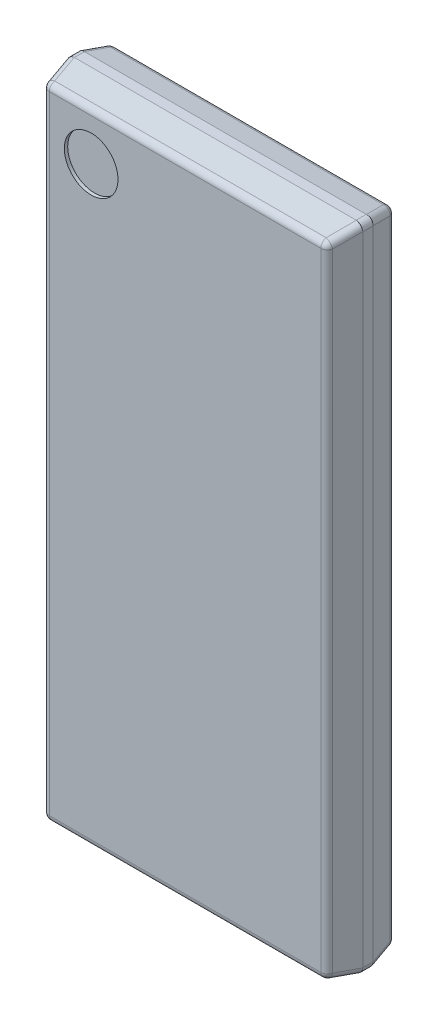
ISO-10303-21;
HEADER;
FILE_DESCRIPTION(('STEP AP214'),'2;1');
FILE_NAME('part.step','',(''),(''),'','','');
FILE_SCHEMA(('AUTOMOTIVE_DESIGN { 1 0 10303 214 1 1 1 1 }'));
ENDSEC;
DATA;
#1=APPLICATION_CONTEXT('core data for automotive mechanical design processes');
#2=APPLICATION_PROTOCOL_DEFINITION('international standard','automotive_design',2000,#1);
#3=PRODUCT_CONTEXT('',#1,'mechanical');
#4=PRODUCT('Part','Part','',(#3));
#5=PRODUCT_RELATED_PRODUCT_CATEGORY('part','',(#4));
#6=PRODUCT_DEFINITION_FORMATION('','',#4);
#7=PRODUCT_DEFINITION_CONTEXT('part definition',#1,'design');
#8=PRODUCT_DEFINITION('design','',#6,#7);
#9=PRODUCT_DEFINITION_SHAPE('','',#8);
#10=(LENGTH_UNIT() NAMED_UNIT(*) SI_UNIT(.MILLI.,.METRE.));
#11=(NAMED_UNIT(*) PLANE_ANGLE_UNIT() SI_UNIT($,.RADIAN.));
#12=(NAMED_UNIT(*) SI_UNIT($,.STERADIAN.) SOLID_ANGLE_UNIT());
#13=UNCERTAINTY_MEASURE_WITH_UNIT(LENGTH_MEASURE(1.E-05),#10,'distance_accuracy_value','');
#14=(GEOMETRIC_REPRESENTATION_CONTEXT(3) GLOBAL_UNCERTAINTY_ASSIGNED_CONTEXT((#13)) GLOBAL_UNIT_ASSIGNED_CONTEXT((#10,
#11,#12)) REPRESENTATION_CONTEXT('',''));
#15=CARTESIAN_POINT('',(0.,0.,0.));
#16=DIRECTION('',(0.,0.,1.));
#17=DIRECTION('',(1.,0.,0.));
#18=AXIS2_PLACEMENT_3D('',#15,#16,#17);
#19=CARTESIAN_POINT('',(0.,0.,0.28));
#20=DIRECTION('',(0.,0.,1.));
#21=DIRECTION('',(1.,0.,0.));
#22=AXIS2_PLACEMENT_3D('',#19,#20,#21);
#23=PLANE('',#22);
#24=DIRECTION('',(1.,0.,0.));
#25=VECTOR('',#24,1.);
#26=CARTESIAN_POINT('',(0.,-2.615,0.28));
#27=LINE('',#26,#25);
#28=CARTESIAN_POINT('',(-0.475,-2.615,0.28));
#29=VERTEX_POINT('',#28);
#30=CARTESIAN_POINT('',(0.475,-2.615,0.28));
#31=VERTEX_POINT('',#30);
#32=EDGE_CURVE('E675',#29,#31,#27,.T.);
#33=ORIENTED_EDGE('',*,*,#32,.F.);
#34=DIRECTION('',(0.,1.,0.));
#35=VECTOR('',#34,1.);
#36=CARTESIAN_POINT('',(-0.475,0.,0.28));
#37=LINE('',#36,#35);
#38=CARTESIAN_POINT('',(-0.475,-2.415,0.28));
#39=VERTEX_POINT('',#38);
#40=EDGE_CURVE('E678',#39,#29,#37,.F.);
#41=ORIENTED_EDGE('',*,*,#40,.F.);
#42=DIRECTION('',(1.,0.,0.));
#43=VECTOR('',#42,1.);
#44=CARTESIAN_POINT('',(0.,-2.415,0.28));
#45=LINE('',#44,#43);
#46=CARTESIAN_POINT('',(-1.375,-2.415,0.28));
#47=VERTEX_POINT('',#46);
#48=EDGE_CURVE('E681',#47,#39,#45,.T.);
#49=ORIENTED_EDGE('',*,*,#48,.F.);
#50=DIRECTION('',(0.,1.,0.));
#51=VECTOR('',#50,1.);
#52=CARTESIAN_POINT('',(-1.375,2.415,0.28));
#53=LINE('',#52,#51);
#54=CARTESIAN_POINT('',(-1.375,2.415,0.28));
#55=VERTEX_POINT('',#54);
#56=EDGE_CURVE('E669',#47,#55,#53,.T.);
#57=ORIENTED_EDGE('',*,*,#56,.T.);
#58=DIRECTION('',(1.,0.,0.));
#59=VECTOR('',#58,1.);
#60=CARTESIAN_POINT('',(1.375,2.415,0.28));
#61=LINE('',#60,#59);
#62=CARTESIAN_POINT('',(-0.475,2.415,0.28));
#63=VERTEX_POINT('',#62);
#64=EDGE_CURVE('E663',#55,#63,#61,.T.);
#65=ORIENTED_EDGE('',*,*,#64,.T.);
#66=DIRECTION('',(0.,1.,0.));
#67=VECTOR('',#66,1.);
#68=CARTESIAN_POINT('',(-0.475,2.615,0.28));
#69=LINE('',#68,#67);
#70=CARTESIAN_POINT('',(-0.475,2.615,0.28));
#71=VERTEX_POINT('',#70);
#72=EDGE_CURVE('E657',#63,#71,#69,.T.);
#73=ORIENTED_EDGE('',*,*,#72,.T.);
#74=DIRECTION('',(1.,0.,0.));
#75=VECTOR('',#74,1.);
#76=CARTESIAN_POINT('',(0.475,2.615,0.28));
#77=LINE('',#76,#75);
#78=CARTESIAN_POINT('',(0.475,2.615,0.28));
#79=VERTEX_POINT('',#78);
#80=EDGE_CURVE('E651',#71,#79,#77,.T.);
#81=ORIENTED_EDGE('',*,*,#80,.T.);
#82=DIRECTION('',(0.,1.,0.));
#83=VECTOR('',#82,1.);
#84=CARTESIAN_POINT('',(0.475,2.415,0.28));
#85=LINE('',#84,#83);
#86=CARTESIAN_POINT('',(0.475,2.415,0.28));
#87=VERTEX_POINT('',#86);
#88=EDGE_CURVE('E645',#79,#87,#85,.F.);
#89=ORIENTED_EDGE('',*,*,#88,.T.);
#90=DIRECTION('',(1.,0.,0.));
#91=VECTOR('',#90,1.);
#92=CARTESIAN_POINT('',(1.375,2.415,0.28));
#93=LINE('',#92,#91);
#94=CARTESIAN_POINT('',(1.375,2.415,0.28));
#95=VERTEX_POINT('',#94);
#96=EDGE_CURVE('E639',#87,#95,#93,.T.);
#97=ORIENTED_EDGE('',*,*,#96,.T.);
#98=DIRECTION('',(0.,1.,0.));
#99=VECTOR('',#98,1.);
#100=CARTESIAN_POINT('',(1.375,-2.415,0.28));
#101=LINE('',#100,#99);
#102=CARTESIAN_POINT('',(1.375,-2.415,0.28));
#103=VERTEX_POINT('',#102);
#104=EDGE_CURVE('E633',#95,#103,#101,.F.);
#105=ORIENTED_EDGE('',*,*,#104,.T.);
#106=DIRECTION('',(1.,0.,0.));
#107=VECTOR('',#106,1.);
#108=CARTESIAN_POINT('',(0.,-2.415,0.28));
#109=LINE('',#108,#107);
#110=CARTESIAN_POINT('',(0.475,-2.415,0.28));
#111=VERTEX_POINT('',#110);
#112=EDGE_CURVE('E684',#111,#103,#109,.T.);
#113=ORIENTED_EDGE('',*,*,#112,.F.);
#114=DIRECTION('',(0.,1.,0.));
#115=VECTOR('',#114,1.);
#116=CARTESIAN_POINT('',(0.475,0.,0.28));
#117=LINE('',#116,#115);
#118=EDGE_CURVE('E672',#31,#111,#117,.T.);
#119=ORIENTED_EDGE('',*,*,#118,.F.);
#120=EDGE_LOOP('',(#33,#41,#49,#57,#65,#73,#81,#89,#97,#105,#113,#119));
#121=FACE_BOUND('',#120,.T.);
#122=ADVANCED_FACE('F17',(#121),#23,.F.);
#123=CARTESIAN_POINT('',(-1.375,2.415,0.13));
#124=DIRECTION('',(-1.,0.,0.));
#125=DIRECTION('',(0.,0.,1.));
#126=AXIS2_PLACEMENT_3D('',#123,#124,#125);
#127=PLANE('',#126);
#128=ORIENTED_EDGE('',*,*,#56,.F.);
#129=DIRECTION('',(0.,0.,-1.));
#130=VECTOR('',#129,1.);
#131=CARTESIAN_POINT('',(-1.375,-2.415,0.13));
#132=LINE('',#131,#130);
#133=CARTESIAN_POINT('',(-1.375,-2.415,0.13));
#134=VERTEX_POINT('',#133);
#135=EDGE_CURVE('E614',#47,#134,#132,.T.);
#136=ORIENTED_EDGE('',*,*,#135,.T.);
#137=DIRECTION('',(0.,1.,0.));
#138=VECTOR('',#137,1.);
#139=CARTESIAN_POINT('',(-1.375,0.,0.13));
#140=LINE('',#139,#138);
#141=CARTESIAN_POINT('',(-1.375,2.415,0.13));
#142=VERTEX_POINT('',#141);
#143=EDGE_CURVE('E617',#134,#142,#140,.T.);
#144=ORIENTED_EDGE('',*,*,#143,.T.);
#145=DIRECTION('',(0.,0.,1.));
#146=VECTOR('',#145,1.);
#147=CARTESIAN_POINT('',(-1.375,2.415,0.13));
#148=LINE('',#147,#146);
#149=EDGE_CURVE('E666',#142,#55,#148,.T.);
#150=ORIENTED_EDGE('',*,*,#149,.T.);
#151=EDGE_LOOP('',(#128,#136,#144,#150));
#152=FACE_BOUND('',#151,.T.);
#153=ADVANCED_FACE('F231',(#152),#127,.F.);
#154=CARTESIAN_POINT('',(1.375,2.415,0.13));
#155=DIRECTION('',(0.,1.,0.));
#156=DIRECTION('',(0.,0.,1.));
#157=AXIS2_PLACEMENT_3D('',#154,#155,#156);
#158=PLANE('',#157);
#159=ORIENTED_EDGE('',*,*,#64,.F.);
#160=ORIENTED_EDGE('',*,*,#149,.F.);
#161=DIRECTION('',(1.,0.,0.));
#162=VECTOR('',#161,1.);
#163=CARTESIAN_POINT('',(0.,2.415,0.13));
#164=LINE('',#163,#162);
#165=CARTESIAN_POINT('',(-0.475,2.415,0.13));
#166=VERTEX_POINT('',#165);
#167=EDGE_CURVE('E1308',#142,#166,#164,.T.);
#168=ORIENTED_EDGE('',*,*,#167,.T.);
#169=DIRECTION('',(0.,0.,1.));
#170=VECTOR('',#169,1.);
#171=CARTESIAN_POINT('',(-0.475,2.415,0.13));
#172=LINE('',#171,#170);
#173=EDGE_CURVE('E660',#166,#63,#172,.T.);
#174=ORIENTED_EDGE('',*,*,#173,.T.);
#175=EDGE_LOOP('',(#159,#160,#168,#174));
#176=FACE_BOUND('',#175,.T.);
#177=ADVANCED_FACE('F228',(#176),#158,.F.);
#178=CARTESIAN_POINT('',(-0.475,2.615,0.13));
#179=DIRECTION('',(-1.,0.,0.));
#180=DIRECTION('',(0.,0.,1.));
#181=AXIS2_PLACEMENT_3D('',#178,#179,#180);
#182=PLANE('',#181);
#183=ORIENTED_EDGE('',*,*,#72,.F.);
#184=ORIENTED_EDGE('',*,*,#173,.F.);
#185=DIRECTION('',(0.,1.,0.));
#186=VECTOR('',#185,1.);
#187=CARTESIAN_POINT('',(-0.475,0.,0.13));
#188=LINE('',#187,#186);
#189=CARTESIAN_POINT('',(-0.475,2.615,0.13));
#190=VERTEX_POINT('',#189);
#191=EDGE_CURVE('E1306',#166,#190,#188,.T.);
#192=ORIENTED_EDGE('',*,*,#191,.T.);
#193=DIRECTION('',(0.,0.,1.));
#194=VECTOR('',#193,1.);
#195=CARTESIAN_POINT('',(-0.475,2.615,0.13));
#196=LINE('',#195,#194);
#197=EDGE_CURVE('E654',#190,#71,#196,.T.);
#198=ORIENTED_EDGE('',*,*,#197,.T.);
#199=EDGE_LOOP('',(#183,#184,#192,#198));
#200=FACE_BOUND('',#199,.T.);
#201=ADVANCED_FACE('F224',(#200),#182,.F.);
#202=CARTESIAN_POINT('',(0.475,2.615,0.13));
#203=DIRECTION('',(0.,1.,0.));
#204=DIRECTION('',(0.,0.,1.));
#205=AXIS2_PLACEMENT_3D('',#202,#203,#204);
#206=PLANE('',#205);
#207=ORIENTED_EDGE('',*,*,#80,.F.);
#208=ORIENTED_EDGE('',*,*,#197,.F.);
#209=DIRECTION('',(1.,0.,0.));
#210=VECTOR('',#209,1.);
#211=CARTESIAN_POINT('',(0.,2.615,0.13));
#212=LINE('',#211,#210);
#213=CARTESIAN_POINT('',(0.475,2.615,0.13));
#214=VERTEX_POINT('',#213);
#215=EDGE_CURVE('E1304',#190,#214,#212,.T.);
#216=ORIENTED_EDGE('',*,*,#215,.T.);
#217=DIRECTION('',(0.,0.,-1.));
#218=VECTOR('',#217,1.);
#219=CARTESIAN_POINT('',(0.475,2.615,0.13));
#220=LINE('',#219,#218);
#221=EDGE_CURVE('E648',#214,#79,#220,.F.);
#222=ORIENTED_EDGE('',*,*,#221,.T.);
#223=EDGE_LOOP('',(#207,#208,#216,#222));
#224=FACE_BOUND('',#223,.T.);
#225=ADVANCED_FACE('F220',(#224),#206,.F.);
#226=CARTESIAN_POINT('',(0.475,2.415,0.13));
#227=DIRECTION('',(1.,0.,0.));
#228=DIRECTION('',(0.,0.,-1.));
#229=AXIS2_PLACEMENT_3D('',#226,#227,#228);
#230=PLANE('',#229);
#231=ORIENTED_EDGE('',*,*,#88,.F.);
#232=ORIENTED_EDGE('',*,*,#221,.F.);
#233=DIRECTION('',(0.,1.,0.));
#234=VECTOR('',#233,1.);
#235=CARTESIAN_POINT('',(0.475,0.,0.13));
#236=LINE('',#235,#234);
#237=CARTESIAN_POINT('',(0.475,2.415,0.13));
#238=VERTEX_POINT('',#237);
#239=EDGE_CURVE('E1302',#214,#238,#236,.F.);
#240=ORIENTED_EDGE('',*,*,#239,.T.);
#241=DIRECTION('',(0.,0.,1.));
#242=VECTOR('',#241,1.);
#243=CARTESIAN_POINT('',(0.475,2.415,0.13));
#244=LINE('',#243,#242);
#245=EDGE_CURVE('E642',#238,#87,#244,.T.);
#246=ORIENTED_EDGE('',*,*,#245,.T.);
#247=EDGE_LOOP('',(#231,#232,#240,#246));
#248=FACE_BOUND('',#247,.T.);
#249=ADVANCED_FACE('F216',(#248),#230,.F.);
#250=CARTESIAN_POINT('',(1.375,2.415,0.13));
#251=DIRECTION('',(0.,1.,0.));
#252=DIRECTION('',(0.,0.,1.));
#253=AXIS2_PLACEMENT_3D('',#250,#251,#252);
#254=PLANE('',#253);
#255=ORIENTED_EDGE('',*,*,#96,.F.);
#256=ORIENTED_EDGE('',*,*,#245,.F.);
#257=DIRECTION('',(1.,0.,0.));
#258=VECTOR('',#257,1.);
#259=CARTESIAN_POINT('',(0.,2.415,0.13));
#260=LINE('',#259,#258);
#261=CARTESIAN_POINT('',(1.375,2.415,0.13));
#262=VERTEX_POINT('',#261);
#263=EDGE_CURVE('E1300',#238,#262,#260,.T.);
#264=ORIENTED_EDGE('',*,*,#263,.T.);
#265=DIRECTION('',(0.,0.,-1.));
#266=VECTOR('',#265,1.);
#267=CARTESIAN_POINT('',(1.375,2.415,0.13));
#268=LINE('',#267,#266);
#269=EDGE_CURVE('E636',#262,#95,#268,.F.);
#270=ORIENTED_EDGE('',*,*,#269,.T.);
#271=EDGE_LOOP('',(#255,#256,#264,#270));
#272=FACE_BOUND('',#271,.T.);
#273=ADVANCED_FACE('F212',(#272),#254,.F.);
#274=CARTESIAN_POINT('',(1.375,-2.415,0.13));
#275=DIRECTION('',(1.,0.,0.));
#276=DIRECTION('',(0.,0.,-1.));
#277=AXIS2_PLACEMENT_3D('',#274,#275,#276);
#278=PLANE('',#277);
#279=ORIENTED_EDGE('',*,*,#104,.F.);
#280=ORIENTED_EDGE('',*,*,#269,.F.);
#281=DIRECTION('',(0.,1.,0.));
#282=VECTOR('',#281,1.);
#283=CARTESIAN_POINT('',(1.375,0.,0.13));
#284=LINE('',#283,#282);
#285=CARTESIAN_POINT('',(1.375,-2.415,0.13));
#286=VERTEX_POINT('',#285);
#287=EDGE_CURVE('E1298',#262,#286,#284,.F.);
#288=ORIENTED_EDGE('',*,*,#287,.T.);
#289=DIRECTION('',(0.,0.,-1.));
#290=VECTOR('',#289,1.);
#291=CARTESIAN_POINT('',(1.375,-2.415,0.13));
#292=LINE('',#291,#290);
#293=EDGE_CURVE('E630',#286,#103,#292,.F.);
#294=ORIENTED_EDGE('',*,*,#293,.T.);
#295=EDGE_LOOP('',(#279,#280,#288,#294));
#296=FACE_BOUND('',#295,.T.);
#297=ADVANCED_FACE('F208',(#296),#278,.F.);
#298=CARTESIAN_POINT('',(-1.375,-2.415,0.13));
#299=DIRECTION('',(0.,-1.,0.));
#300=DIRECTION('',(0.,0.,-1.));
#301=AXIS2_PLACEMENT_3D('',#298,#299,#300);
#302=PLANE('',#301);
#303=ORIENTED_EDGE('',*,*,#112,.T.);
#304=ORIENTED_EDGE('',*,*,#293,.F.);
#305=DIRECTION('',(1.,0.,0.));
#306=VECTOR('',#305,1.);
#307=CARTESIAN_POINT('',(0.,-2.415,0.13));
#308=LINE('',#307,#306);
#309=CARTESIAN_POINT('',(0.475,-2.415,0.13));
#310=VERTEX_POINT('',#309);
#311=EDGE_CURVE('E1296',#286,#310,#308,.F.);
#312=ORIENTED_EDGE('',*,*,#311,.T.);
#313=DIRECTION('',(0.,0.,-1.));
#314=VECTOR('',#313,1.);
#315=CARTESIAN_POINT('',(0.475,-2.415,0.13));
#316=LINE('',#315,#314);
#317=EDGE_CURVE('E627',#310,#111,#316,.F.);
#318=ORIENTED_EDGE('',*,*,#317,.T.);
#319=EDGE_LOOP('',(#303,#304,#312,#318));
#320=FACE_BOUND('',#319,.T.);
#321=ADVANCED_FACE('F204',(#320),#302,.F.);
#322=CARTESIAN_POINT('',(0.475,-2.615,0.13));
#323=DIRECTION('',(1.,0.,0.));
#324=DIRECTION('',(0.,0.,-1.));
#325=AXIS2_PLACEMENT_3D('',#322,#323,#324);
#326=PLANE('',#325);
#327=ORIENTED_EDGE('',*,*,#118,.T.);
#328=ORIENTED_EDGE('',*,*,#317,.F.);
#329=DIRECTION('',(0.,1.,0.));
#330=VECTOR('',#329,1.);
#331=CARTESIAN_POINT('',(0.475,0.,0.13));
#332=LINE('',#331,#330);
#333=CARTESIAN_POINT('',(0.475,-2.615,0.13));
#334=VERTEX_POINT('',#333);
#335=EDGE_CURVE('E1294',#310,#334,#332,.F.);
#336=ORIENTED_EDGE('',*,*,#335,.T.);
#337=DIRECTION('',(0.,0.,-1.));
#338=VECTOR('',#337,1.);
#339=CARTESIAN_POINT('',(0.475,-2.615,0.13));
#340=LINE('',#339,#338);
#341=EDGE_CURVE('E624',#334,#31,#340,.F.);
#342=ORIENTED_EDGE('',*,*,#341,.T.);
#343=EDGE_LOOP('',(#327,#328,#336,#342));
#344=FACE_BOUND('',#343,.T.);
#345=ADVANCED_FACE('F200',(#344),#326,.F.);
#346=CARTESIAN_POINT('',(-0.475,-2.615,0.13));
#347=DIRECTION('',(0.,-1.,0.));
#348=DIRECTION('',(0.,0.,-1.));
#349=AXIS2_PLACEMENT_3D('',#346,#347,#348);
#350=PLANE('',#349);
#351=ORIENTED_EDGE('',*,*,#32,.T.);
#352=ORIENTED_EDGE('',*,*,#341,.F.);
#353=DIRECTION('',(1.,0.,0.));
#354=VECTOR('',#353,1.);
#355=CARTESIAN_POINT('',(0.,-2.615,0.13));
#356=LINE('',#355,#354);
#357=CARTESIAN_POINT('',(-0.475,-2.615,0.13));
#358=VERTEX_POINT('',#357);
#359=EDGE_CURVE('E1284',#334,#358,#356,.F.);
#360=ORIENTED_EDGE('',*,*,#359,.T.);
#361=DIRECTION('',(0.,0.,1.));
#362=VECTOR('',#361,1.);
#363=CARTESIAN_POINT('',(-0.475,-2.615,0.13));
#364=LINE('',#363,#362);
#365=EDGE_CURVE('E621',#358,#29,#364,.T.);
#366=ORIENTED_EDGE('',*,*,#365,.T.);
#367=EDGE_LOOP('',(#351,#352,#360,#366));
#368=FACE_BOUND('',#367,.T.);
#369=ADVANCED_FACE('F196',(#368),#350,.F.);
#370=CARTESIAN_POINT('',(-0.475,-2.415,0.13));
#371=DIRECTION('',(-1.,0.,0.));
#372=DIRECTION('',(0.,0.,1.));
#373=AXIS2_PLACEMENT_3D('',#370,#371,#372);
#374=PLANE('',#373);
#375=ORIENTED_EDGE('',*,*,#40,.T.);
#376=ORIENTED_EDGE('',*,*,#365,.F.);
#377=DIRECTION('',(0.,1.,0.));
#378=VECTOR('',#377,1.);
#379=CARTESIAN_POINT('',(-0.475,0.,0.13));
#380=LINE('',#379,#378);
#381=CARTESIAN_POINT('',(-0.475,-2.415,0.13));
#382=VERTEX_POINT('',#381);
#383=EDGE_CURVE('E1278',#358,#382,#380,.T.);
#384=ORIENTED_EDGE('',*,*,#383,.T.);
#385=DIRECTION('',(0.,0.,-1.));
#386=VECTOR('',#385,1.);
#387=CARTESIAN_POINT('',(-0.475,-2.415,0.13));
#388=LINE('',#387,#386);
#389=EDGE_CURVE('E618',#382,#39,#388,.F.);
#390=ORIENTED_EDGE('',*,*,#389,.T.);
#391=EDGE_LOOP('',(#375,#376,#384,#390));
#392=FACE_BOUND('',#391,.T.);
#393=ADVANCED_FACE('F192',(#392),#374,.F.);
#394=CARTESIAN_POINT('',(-1.375,-2.415,0.13));
#395=DIRECTION('',(0.,-1.,0.));
#396=DIRECTION('',(0.,0.,-1.));
#397=AXIS2_PLACEMENT_3D('',#394,#395,#396);
#398=PLANE('',#397);
#399=ORIENTED_EDGE('',*,*,#48,.T.);
#400=ORIENTED_EDGE('',*,*,#389,.F.);
#401=DIRECTION('',(1.,0.,0.));
#402=VECTOR('',#401,1.);
#403=CARTESIAN_POINT('',(0.,-2.415,0.13));
#404=LINE('',#403,#402);
#405=EDGE_CURVE('E1283',#382,#134,#404,.F.);
#406=ORIENTED_EDGE('',*,*,#405,.T.);
#407=ORIENTED_EDGE('',*,*,#135,.F.);
#408=EDGE_LOOP('',(#399,#400,#406,#407));
#409=FACE_BOUND('',#408,.T.);
#410=ADVANCED_FACE('F188',(#409),#398,.F.);
#411=CARTESIAN_POINT('',(0.,0.,0.13));
#412=DIRECTION('',(0.,0.,1.));
#413=DIRECTION('',(1.,0.,0.));
#414=AXIS2_PLACEMENT_3D('',#411,#412,#413);
#415=PLANE('',#414);
#416=ORIENTED_EDGE('',*,*,#383,.F.);
#417=ORIENTED_EDGE('',*,*,#359,.F.);
#418=ORIENTED_EDGE('',*,*,#335,.F.);
#419=ORIENTED_EDGE('',*,*,#311,.F.);
#420=ORIENTED_EDGE('',*,*,#287,.F.);
#421=ORIENTED_EDGE('',*,*,#263,.F.);
#422=ORIENTED_EDGE('',*,*,#239,.F.);
#423=ORIENTED_EDGE('',*,*,#215,.F.);
#424=ORIENTED_EDGE('',*,*,#191,.F.);
#425=ORIENTED_EDGE('',*,*,#167,.F.);
#426=ORIENTED_EDGE('',*,*,#143,.F.);
#427=ORIENTED_EDGE('',*,*,#405,.F.);
#428=EDGE_LOOP('',(#416,#417,#418,#419,#420,#421,#422,#423,#424,#425,#426,#427));
#429=FACE_BOUND('',#428,.T.);
#430=DIRECTION('',(0.,-1.,0.));
#431=VECTOR('',#430,1.);
#432=CARTESIAN_POINT('',(2.033998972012,17.49492,0.13));
#433=LINE('',#432,#431);
#434=CARTESIAN_POINT('',(2.033998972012,-4.683998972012,0.13));
#435=VERTEX_POINT('',#434);
#436=CARTESIAN_POINT('',(2.033998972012,4.683998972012,0.13));
#437=VERTEX_POINT('',#436);
#438=EDGE_CURVE('E606',#435,#437,#433,.F.);
#439=ORIENTED_EDGE('',*,*,#438,.F.);
#440=DIRECTION('',(-1.,0.,0.));
#441=VECTOR('',#440,1.);
#442=CARTESIAN_POINT('',(7.93584,-4.683998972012,0.13));
#443=LINE('',#442,#441);
#444=CARTESIAN_POINT('',(-2.033998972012,-4.683998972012,0.13));
#445=VERTEX_POINT('',#444);
#446=EDGE_CURVE('E100',#445,#435,#443,.F.);
#447=ORIENTED_EDGE('',*,*,#446,.F.);
#448=DIRECTION('',(0.,1.,0.));
#449=VECTOR('',#448,1.);
#450=CARTESIAN_POINT('',(-2.033998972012,-17.49492,0.13));
#451=LINE('',#450,#449);
#452=CARTESIAN_POINT('',(-2.03399897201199,4.683998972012,0.13));
#453=VERTEX_POINT('',#452);
#454=EDGE_CURVE('E594',#453,#445,#451,.F.);
#455=ORIENTED_EDGE('',*,*,#454,.F.);
#456=DIRECTION('',(1.,0.,0.));
#457=VECTOR('',#456,1.);
#458=CARTESIAN_POINT('',(-7.93584,4.683998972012,0.13));
#459=LINE('',#458,#457);
#460=EDGE_CURVE('E604',#437,#453,#459,.F.);
#461=ORIENTED_EDGE('',*,*,#460,.F.);
#462=EDGE_LOOP('',(#439,#447,#455,#461));
#463=FACE_BOUND('',#462,.T.);
#464=ADVANCED_FACE('F185',(#429,#463),#415,.F.);
#465=CARTESIAN_POINT('',(7.93584,-4.683998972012,0.23));
#466=DIRECTION('',(-1.,0.,0.));
#467=DIRECTION('',(0.,0.,1.));
#468=AXIS2_PLACEMENT_3D('',#465,#466,#467);
#469=CYLINDRICAL_SURFACE('',#468,0.1);
#470=CARTESIAN_POINT('',(-2.033998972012,-4.683998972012,0.23));
#471=DIRECTION('',(-1.,0.,0.));
#472=DIRECTION('',(0.,0.,1.));
#473=AXIS2_PLACEMENT_3D('',#470,#471,#472);
#474=CIRCLE('',#473,0.1);
#475=CARTESIAN_POINT('',(-2.033998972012,-4.78181373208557,0.209208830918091));
#476=VERTEX_POINT('',#475);
#477=EDGE_CURVE('E589',#445,#476,#474,.T.);
#478=ORIENTED_EDGE('',*,*,#477,.F.);
#479=ORIENTED_EDGE('',*,*,#446,.T.);
#480=CARTESIAN_POINT('',(2.033998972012,-4.683998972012,0.23));
#481=DIRECTION('',(-1.,0.,0.));
#482=DIRECTION('',(0.,0.,1.));
#483=AXIS2_PLACEMENT_3D('',#480,#481,#482);
#484=CIRCLE('',#483,0.1);
#485=CARTESIAN_POINT('',(2.03399897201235,-4.78181373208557,0.209208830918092));
#486=VERTEX_POINT('',#485);
#487=EDGE_CURVE('E20',#486,#435,#484,.F.);
#488=ORIENTED_EDGE('',*,*,#487,.F.);
#489=DIRECTION('',(1.,0.,0.));
#490=VECTOR('',#489,1.);
#491=CARTESIAN_POINT('',(-2.2,-4.78181373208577,0.209208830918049));
#492=LINE('',#491,#490);
#493=EDGE_CURVE('E98',#476,#486,#492,.T.);
#494=ORIENTED_EDGE('',*,*,#493,.F.);
#495=EDGE_LOOP('',(#478,#479,#488,#494));
#496=FACE_BOUND('',#495,.T.);
#497=ADVANCED_FACE('F96',(#496),#469,.T.);
#498=CARTESIAN_POINT('',(2.033998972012,-4.683998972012,0.23));
#499=DIRECTION('',(0.677173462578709,-0.677173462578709,-0.287875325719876));
#500=DIRECTION('',(-0.203558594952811,0.203558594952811,-0.957667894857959));
#501=AXIS2_PLACEMENT_3D('',#498,#499,#500);
#502=SPHERICAL_SURFACE('',#501,0.1);
#503=CARTESIAN_POINT('',(2.03399897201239,-4.68399897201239,0.229999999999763));
#504=DIRECTION('',(-0.203558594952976,0.203558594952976,-0.957667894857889));
#505=DIRECTION('',(-0.978147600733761,0.,0.20791169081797));
#506=AXIS2_PLACEMENT_3D('',#503,#504,#505);
#507=CIRCLE('',#506,0.1);
#508=CARTESIAN_POINT('',(2.10171631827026,-4.75171631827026,0.201212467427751));
#509=VERTEX_POINT('',#508);
#510=EDGE_CURVE('E103',#486,#509,#507,.F.);
#511=ORIENTED_EDGE('',*,*,#510,.F.);
#512=ORIENTED_EDGE('',*,*,#487,.T.);
#513=CARTESIAN_POINT('',(2.033998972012,-4.683998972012,0.23));
#514=DIRECTION('',(0.,-1.,0.));
#515=DIRECTION('',(0.,0.,-1.));
#516=AXIS2_PLACEMENT_3D('',#513,#514,#515);
#517=CIRCLE('',#516,0.1);
#518=CARTESIAN_POINT('',(2.13181373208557,-4.683998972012,0.209208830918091));
#519=VERTEX_POINT('',#518);
#520=EDGE_CURVE('E102',#519,#435,#517,.F.);
#521=ORIENTED_EDGE('',*,*,#520,.F.);
#522=CARTESIAN_POINT('',(2.03399897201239,-4.68399897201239,0.229999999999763));
#523=DIRECTION('',(-0.203558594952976,0.203558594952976,-0.957667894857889));
#524=DIRECTION('',(-0.978147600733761,0.,0.20791169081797));
#525=AXIS2_PLACEMENT_3D('',#522,#523,#524);
#526=CIRCLE('',#525,0.1);
#527=EDGE_CURVE('E35',#509,#519,#526,.F.);
#528=ORIENTED_EDGE('',*,*,#527,.F.);
#529=EDGE_LOOP('',(#511,#512,#521,#528));
#530=FACE_BOUND('',#529,.T.);
#531=ADVANCED_FACE('F104',(#530),#502,.T.);
#532=CARTESIAN_POINT('',(2.033998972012,17.49492,0.23));
#533=DIRECTION('',(0.,-1.,0.));
#534=DIRECTION('',(0.,0.,-1.));
#535=AXIS2_PLACEMENT_3D('',#532,#533,#534);
#536=CYLINDRICAL_SURFACE('',#535,0.1);
#537=ORIENTED_EDGE('',*,*,#520,.T.);
#538=ORIENTED_EDGE('',*,*,#438,.T.);
#539=CARTESIAN_POINT('',(2.033998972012,4.683998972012,0.23));
#540=DIRECTION('',(0.,-1.,0.));
#541=DIRECTION('',(0.,0.,-1.));
#542=AXIS2_PLACEMENT_3D('',#539,#540,#541);
#543=CIRCLE('',#542,0.1);
#544=CARTESIAN_POINT('',(2.13181373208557,4.68399897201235,0.209208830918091));
#545=VERTEX_POINT('',#544);
#546=EDGE_CURVE('E599',#545,#437,#543,.F.);
#547=ORIENTED_EDGE('',*,*,#546,.F.);
#548=DIRECTION('',(0.,1.,0.));
#549=VECTOR('',#548,1.);
#550=CARTESIAN_POINT('',(2.13181373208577,-4.85,0.209208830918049));
#551=LINE('',#550,#549);
#552=EDGE_CURVE('E166',#519,#545,#551,.T.);
#553=ORIENTED_EDGE('',*,*,#552,.F.);
#554=EDGE_LOOP('',(#537,#538,#547,#553));
#555=FACE_BOUND('',#554,.T.);
#556=ADVANCED_FACE('F182',(#555),#536,.T.);
#557=CARTESIAN_POINT('',(-7.93584,4.683998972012,0.23));
#558=DIRECTION('',(1.,0.,0.));
#559=DIRECTION('',(0.,0.,-1.));
#560=AXIS2_PLACEMENT_3D('',#557,#558,#559);
#561=CYLINDRICAL_SURFACE('',#560,0.1);
#562=CARTESIAN_POINT('',(-2.033998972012,4.683998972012,0.23));
#563=DIRECTION('',(1.,0.,0.));
#564=DIRECTION('',(0.,0.,-1.));
#565=AXIS2_PLACEMENT_3D('',#562,#563,#564);
#566=CIRCLE('',#565,0.1);
#567=CARTESIAN_POINT('',(-2.03399897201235,4.78181373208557,0.209208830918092));
#568=VERTEX_POINT('',#567);
#569=CARTESIAN_POINT('',(-2.033998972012,4.74693101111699,0.15228540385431));
#570=VERTEX_POINT('',#569);
#571=EDGE_CURVE('E165',#568,#570,#566,.F.);
#572=ORIENTED_EDGE('',*,*,#571,.F.);
#573=DIRECTION('',(1.,0.,0.));
#574=VECTOR('',#573,1.);
#575=CARTESIAN_POINT('',(2.2,4.78181373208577,0.209208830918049));
#576=LINE('',#575,#574);
#577=CARTESIAN_POINT('',(2.033998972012,4.78181373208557,0.209208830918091));
#578=VERTEX_POINT('',#577);
#579=EDGE_CURVE('E139',#578,#568,#576,.F.);
#580=ORIENTED_EDGE('',*,*,#579,.F.);
#581=CARTESIAN_POINT('',(2.033998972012,4.683998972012,0.23));
#582=DIRECTION('',(1.,0.,0.));
#583=DIRECTION('',(0.,0.,-1.));
#584=AXIS2_PLACEMENT_3D('',#581,#582,#583);
#585=CIRCLE('',#584,0.1);
#586=EDGE_CURVE('E602',#437,#578,#585,.T.);
#587=ORIENTED_EDGE('',*,*,#586,.F.);
#588=ORIENTED_EDGE('',*,*,#460,.T.);
#589=CARTESIAN_POINT('',(-2.033998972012,4.683998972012,0.23));
#590=DIRECTION('',(-1.,-3.21798143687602E-13,-2.60569343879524E-13));
#591=DIRECTION('',(0.,0.629320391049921,-0.777145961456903));
#592=AXIS2_PLACEMENT_3D('',#589,#590,#591);
#593=CIRCLE('',#592,0.1);
#594=EDGE_CURVE('E161',#570,#453,#593,.T.);
#595=ORIENTED_EDGE('',*,*,#594,.F.);
#596=EDGE_LOOP('',(#572,#580,#587,#588,#595));
#597=FACE_BOUND('',#596,.T.);
#598=ADVANCED_FACE('F869',(#597),#561,.T.);
#599=CARTESIAN_POINT('',(2.033998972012,4.683998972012,0.23));
#600=DIRECTION('',(0.67717346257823,0.677173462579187,-0.287875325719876));
#601=DIRECTION('',(-0.203558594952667,-0.203558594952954,-0.957667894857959));
#602=AXIS2_PLACEMENT_3D('',#599,#600,#601);
#603=SPHERICAL_SURFACE('',#602,0.1);
#604=CARTESIAN_POINT('',(2.03399897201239,4.68399897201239,0.229999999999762));
#605=DIRECTION('',(-0.203558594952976,-0.203558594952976,-0.957667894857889));
#606=DIRECTION('',(-0.978147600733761,0.,0.20791169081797));
#607=AXIS2_PLACEMENT_3D('',#604,#605,#606);
#608=CIRCLE('',#607,0.1);
#609=CARTESIAN_POINT('',(2.10171631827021,4.75171631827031,0.201212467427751));
#610=VERTEX_POINT('',#609);
#611=EDGE_CURVE('E169',#545,#610,#608,.F.);
#612=ORIENTED_EDGE('',*,*,#611,.F.);
#613=ORIENTED_EDGE('',*,*,#546,.T.);
#614=ORIENTED_EDGE('',*,*,#586,.T.);
#615=CARTESIAN_POINT('',(2.03399897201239,4.68399897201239,0.229999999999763));
#616=DIRECTION('',(-0.203558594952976,-0.203558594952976,-0.957667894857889));
#617=DIRECTION('',(-0.978147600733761,0.,0.20791169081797));
#618=AXIS2_PLACEMENT_3D('',#615,#616,#617);
#619=CIRCLE('',#618,0.1);
#620=EDGE_CURVE('E171',#610,#578,#619,.F.);
#621=ORIENTED_EDGE('',*,*,#620,.F.);
#622=EDGE_LOOP('',(#612,#613,#614,#621));
#623=FACE_BOUND('',#622,.T.);
#624=ADVANCED_FACE('F155',(#623),#603,.T.);
#625=CARTESIAN_POINT('',(-2.033998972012,4.683998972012,0.23));
#626=DIRECTION('',(0.,0.629320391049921,-0.777145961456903));
#627=DIRECTION('',(-1.,0.,0.));
#628=AXIS2_PLACEMENT_3D('',#625,#626,#627);
#629=SPHERICAL_SURFACE('',#628,0.1);
#630=ORIENTED_EDGE('',*,*,#571,.T.);
#631=ORIENTED_EDGE('',*,*,#594,.T.);
#632=CARTESIAN_POINT('',(-2.033998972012,4.683998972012,0.23));
#633=DIRECTION('',(0.,1.,0.));
#634=DIRECTION('',(0.,0.,1.));
#635=AXIS2_PLACEMENT_3D('',#632,#633,#634);
#636=CIRCLE('',#635,0.1);
#637=CARTESIAN_POINT('',(-2.13181373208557,4.6839989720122,0.20920883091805));
#638=VERTEX_POINT('',#637);
#639=EDGE_CURVE('E164',#638,#453,#636,.F.);
#640=ORIENTED_EDGE('',*,*,#639,.F.);
#641=CARTESIAN_POINT('',(-2.03399897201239,4.68399897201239,0.229999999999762));
#642=DIRECTION('',(0.203558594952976,-0.203558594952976,-0.957667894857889));
#643=DIRECTION('',(-0.978147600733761,0.,-0.20791169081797));
#644=AXIS2_PLACEMENT_3D('',#641,#642,#643);
#645=CIRCLE('',#644,0.1);
#646=EDGE_CURVE('E445',#568,#638,#645,.F.);
#647=ORIENTED_EDGE('',*,*,#646,.F.);
#648=EDGE_LOOP('',(#630,#631,#640,#647));
#649=FACE_BOUND('',#648,.T.);
#650=ADVANCED_FACE('F151',(#649),#629,.T.);
#651=CARTESIAN_POINT('',(-2.033998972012,-17.49492,0.23));
#652=DIRECTION('',(0.,1.,0.));
#653=DIRECTION('',(0.,0.,1.));
#654=AXIS2_PLACEMENT_3D('',#651,#652,#653);
#655=CYLINDRICAL_SURFACE('',#654,0.1);
#656=CARTESIAN_POINT('',(-2.033998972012,-4.683998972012,0.23));
#657=DIRECTION('',(0.,1.,0.));
#658=DIRECTION('',(0.,0.,1.));
#659=AXIS2_PLACEMENT_3D('',#656,#657,#658);
#660=CIRCLE('',#659,0.1);
#661=CARTESIAN_POINT('',(-2.13181373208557,-4.6839989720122,0.20920883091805));
#662=VERTEX_POINT('',#661);
#663=EDGE_CURVE('E591',#662,#445,#660,.F.);
#664=ORIENTED_EDGE('',*,*,#663,.F.);
#665=DIRECTION('',(0.,1.,0.));
#666=VECTOR('',#665,1.);
#667=CARTESIAN_POINT('',(-2.13181373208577,4.85,0.209208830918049));
#668=LINE('',#667,#666);
#669=EDGE_CURVE('E132',#638,#662,#668,.F.);
#670=ORIENTED_EDGE('',*,*,#669,.F.);
#671=ORIENTED_EDGE('',*,*,#639,.T.);
#672=ORIENTED_EDGE('',*,*,#454,.T.);
#673=EDGE_LOOP('',(#664,#670,#671,#672));
#674=FACE_BOUND('',#673,.T.);
#675=ADVANCED_FACE('F146',(#674),#655,.T.);
#676=CARTESIAN_POINT('',(-2.033998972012,-4.683998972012,0.23));
#677=DIRECTION('',(-0.67717346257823,-0.677173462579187,-0.287875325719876));
#678=DIRECTION('',(0.203558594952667,0.203558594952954,-0.957667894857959));
#679=AXIS2_PLACEMENT_3D('',#676,#677,#678);
#680=SPHERICAL_SURFACE('',#679,0.1);
#681=ORIENTED_EDGE('',*,*,#663,.T.);
#682=ORIENTED_EDGE('',*,*,#477,.T.);
#683=CARTESIAN_POINT('',(-2.03399897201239,-4.68399897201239,0.229999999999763));
#684=DIRECTION('',(0.203558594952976,0.203558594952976,-0.957667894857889));
#685=DIRECTION('',(-0.978147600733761,0.,-0.20791169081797));
#686=AXIS2_PLACEMENT_3D('',#683,#684,#685);
#687=CIRCLE('',#686,0.1);
#688=CARTESIAN_POINT('',(-2.10171631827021,-4.75171631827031,0.201212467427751));
#689=VERTEX_POINT('',#688);
#690=EDGE_CURVE('E435',#689,#476,#687,.F.);
#691=ORIENTED_EDGE('',*,*,#690,.F.);
#692=CARTESIAN_POINT('',(-2.03399897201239,-4.68399897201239,0.229999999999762));
#693=DIRECTION('',(0.203558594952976,0.203558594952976,-0.957667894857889));
#694=DIRECTION('',(-0.978147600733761,0.,-0.20791169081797));
#695=AXIS2_PLACEMENT_3D('',#692,#693,#694);
#696=CIRCLE('',#695,0.1);
#697=EDGE_CURVE('E134',#662,#689,#696,.F.);
#698=ORIENTED_EDGE('',*,*,#697,.F.);
#699=EDGE_LOOP('',(#681,#682,#691,#698));
#700=FACE_BOUND('',#699,.T.);
#701=ADVANCED_FACE('F142',(#700),#680,.T.);
#702=CARTESIAN_POINT('',(-2.2,-4.85,0.53));
#703=DIRECTION('',(0.,-0.978147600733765,-0.20791169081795));
#704=DIRECTION('',(0.,0.20791169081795,-0.978147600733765));
#705=AXIS2_PLACEMENT_3D('',#702,#703,#704);
#706=PLANE('',#705);
#707=ORIENTED_EDGE('',*,*,#493,.T.);
#708=DIRECTION('',(-0.203558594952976,0.203558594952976,-0.957667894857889));
#709=VECTOR('',#708,1.);
#710=CARTESIAN_POINT('',(2.50238861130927,-5.25020337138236,2.41280883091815));
#711=LINE('',#710,#709);
#712=CARTESIAN_POINT('',(2.10216186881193,-4.84997662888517,0.529890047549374));
#713=VERTEX_POINT('',#712);
#714=EDGE_CURVE('E112',#713,#486,#711,.T.);
#715=ORIENTED_EDGE('',*,*,#714,.F.);
#716=CARTESIAN_POINT('',(2.1,-4.75,0.0595369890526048));
#717=DIRECTION('',(0.,-0.978147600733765,-0.20791169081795));
#718=DIRECTION('',(0.,0.20791169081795,-0.978147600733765));
#719=AXIS2_PLACEMENT_3D('',#716,#717,#718);
#720=ELLIPSE('',#719,0.480973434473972,0.1);
#721=CARTESIAN_POINT('',(2.1,-4.85,0.53));
#722=VERTEX_POINT('',#721);
#723=EDGE_CURVE('E587',#713,#722,#720,.T.);
#724=ORIENTED_EDGE('',*,*,#723,.T.);
#725=DIRECTION('',(1.,0.,0.));
#726=VECTOR('',#725,1.);
#727=CARTESIAN_POINT('',(-2.2,-4.85,0.53));
#728=LINE('',#727,#726);
#729=CARTESIAN_POINT('',(-2.1,-4.85,0.53));
#730=VERTEX_POINT('',#729);
#731=EDGE_CURVE('E430',#730,#722,#728,.T.);
#732=ORIENTED_EDGE('',*,*,#731,.F.);
#733=CARTESIAN_POINT('',(-2.1,-4.75,0.0595369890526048));
#734=DIRECTION('',(0.,-0.978147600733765,-0.20791169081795));
#735=DIRECTION('',(0.,0.20791169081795,-0.978147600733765));
#736=AXIS2_PLACEMENT_3D('',#733,#734,#735);
#737=ELLIPSE('',#736,0.480973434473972,0.1);
#738=CARTESIAN_POINT('',(-2.10216186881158,-4.84997662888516,0.529890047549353));
#739=VERTEX_POINT('',#738);
#740=EDGE_CURVE('E117',#730,#739,#737,.T.);
#741=ORIENTED_EDGE('',*,*,#740,.T.);
#742=DIRECTION('',(0.203558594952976,0.203558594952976,-0.957667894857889));
#743=VECTOR('',#742,1.);
#744=CARTESIAN_POINT('',(-2.50238861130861,-5.25020337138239,2.41280883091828));
#745=LINE('',#744,#743);
#746=EDGE_CURVE('E115',#476,#739,#745,.F.);
#747=ORIENTED_EDGE('',*,*,#746,.F.);
#748=EDGE_LOOP('',(#707,#715,#724,#732,#741,#747));
#749=FACE_BOUND('',#748,.T.);
#750=ADVANCED_FACE('F111',(#749),#706,.T.);
#751=CARTESIAN_POINT('',(2.502388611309,-5.152388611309,2.4336));
#752=DIRECTION('',(-0.203558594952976,0.203558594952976,-0.957667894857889));
#753=DIRECTION('',(-0.978147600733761,0.,0.20791169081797));
#754=AXIS2_PLACEMENT_3D('',#751,#752,#753);
#755=CYLINDRICAL_SURFACE('',#754,0.1);
#756=CARTESIAN_POINT('',(2.1,-4.75,0.540510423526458));
#757=DIRECTION('',(-0.102873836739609,0.102873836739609,-0.989360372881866));
#758=DIRECTION('',(0.699583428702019,-0.699583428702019,-0.145485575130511));
#759=AXIS2_PLACEMENT_3D('',#756,#757,#758);
#760=ELLIPSE('',#759,0.101075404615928,0.1);
#761=CARTESIAN_POINT('',(2.19997662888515,-4.75216186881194,0.529890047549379));
#762=VERTEX_POINT('',#761);
#763=EDGE_CURVE('E122',#713,#762,#760,.F.);
#764=ORIENTED_EDGE('',*,*,#763,.F.);
#765=ORIENTED_EDGE('',*,*,#714,.T.);
#766=ORIENTED_EDGE('',*,*,#510,.T.);
#767=ORIENTED_EDGE('',*,*,#527,.T.);
#768=DIRECTION('',(-0.203558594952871,0.203558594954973,-0.957667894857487));
#769=VECTOR('',#768,1.);
#770=CARTESIAN_POINT('',(2.19997662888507,-4.752161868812,0.529890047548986));
#771=LINE('',#770,#769);
#772=EDGE_CURVE('E126',#762,#519,#771,.T.);
#773=ORIENTED_EDGE('',*,*,#772,.F.);
#774=EDGE_LOOP('',(#764,#765,#766,#767,#773));
#775=FACE_BOUND('',#774,.T.);
#776=ADVANCED_FACE('F119',(#775),#755,.T.);
#777=CARTESIAN_POINT('',(2.2,-4.85,0.53));
#778=DIRECTION('',(0.978147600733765,0.,-0.20791169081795));
#779=DIRECTION('',(-0.20791169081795,0.,-0.978147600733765));
#780=AXIS2_PLACEMENT_3D('',#777,#778,#779);
#781=PLANE('',#780);
#782=ORIENTED_EDGE('',*,*,#552,.T.);
#783=DIRECTION('',(-0.203558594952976,-0.203558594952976,-0.957667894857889));
#784=VECTOR('',#783,1.);
#785=CARTESIAN_POINT('',(2.60020337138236,5.15238861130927,2.41280883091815));
#786=LINE('',#785,#784);
#787=CARTESIAN_POINT('',(2.19997662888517,4.75216186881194,0.529890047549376));
#788=VERTEX_POINT('',#787);
#789=EDGE_CURVE('E449',#788,#545,#786,.T.);
#790=ORIENTED_EDGE('',*,*,#789,.F.);
#791=CARTESIAN_POINT('',(2.1,4.75,0.059536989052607));
#792=DIRECTION('',(0.978147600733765,0.,-0.20791169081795));
#793=DIRECTION('',(-0.20791169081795,0.,-0.978147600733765));
#794=AXIS2_PLACEMENT_3D('',#791,#792,#793);
#795=ELLIPSE('',#794,0.480973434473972,0.1);
#796=CARTESIAN_POINT('',(2.2,4.75,0.530000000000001));
#797=VERTEX_POINT('',#796);
#798=EDGE_CURVE('E123',#788,#797,#795,.T.);
#799=ORIENTED_EDGE('',*,*,#798,.T.);
#800=DIRECTION('',(0.,1.,0.));
#801=VECTOR('',#800,1.);
#802=CARTESIAN_POINT('',(2.2,-4.85,0.53));
#803=LINE('',#802,#801);
#804=CARTESIAN_POINT('',(2.2,-4.75,0.530000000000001));
#805=VERTEX_POINT('',#804);
#806=EDGE_CURVE('E417',#805,#797,#803,.T.);
#807=ORIENTED_EDGE('',*,*,#806,.F.);
#808=CARTESIAN_POINT('',(2.1,-4.75,0.059536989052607));
#809=DIRECTION('',(0.978147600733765,0.,-0.20791169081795));
#810=DIRECTION('',(-0.20791169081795,0.,-0.978147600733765));
#811=AXIS2_PLACEMENT_3D('',#808,#809,#810);
#812=ELLIPSE('',#811,0.480973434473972,0.1);
#813=EDGE_CURVE('E418',#762,#805,#812,.F.);
#814=ORIENTED_EDGE('',*,*,#813,.F.);
#815=ORIENTED_EDGE('',*,*,#772,.T.);
#816=EDGE_LOOP('',(#782,#790,#799,#807,#814,#815));
#817=FACE_BOUND('',#816,.T.);
#818=ADVANCED_FACE('F841',(#817),#781,.T.);
#819=CARTESIAN_POINT('',(2.2,4.85,0.53));
#820=DIRECTION('',(0.,0.978147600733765,-0.20791169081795));
#821=DIRECTION('',(0.,0.20791169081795,0.978147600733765));
#822=AXIS2_PLACEMENT_3D('',#819,#820,#821);
#823=PLANE('',#822);
#824=CARTESIAN_POINT('',(2.1,4.75,0.0595369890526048));
#825=DIRECTION('',(0.,0.978147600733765,-0.20791169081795));
#826=DIRECTION('',(0.,-0.20791169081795,-0.978147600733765));
#827=AXIS2_PLACEMENT_3D('',#824,#825,#826);
#828=ELLIPSE('',#827,0.480973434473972,0.1);
#829=CARTESIAN_POINT('',(2.1,4.85,0.53));
#830=VERTEX_POINT('',#829);
#831=CARTESIAN_POINT('',(2.10216186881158,4.84997662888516,0.529890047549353));
#832=VERTEX_POINT('',#831);
#833=EDGE_CURVE('E172',#830,#832,#828,.T.);
#834=ORIENTED_EDGE('',*,*,#833,.T.);
#835=DIRECTION('',(-0.203558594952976,-0.203558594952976,-0.957667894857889));
#836=VECTOR('',#835,1.);
#837=CARTESIAN_POINT('',(2.50238861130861,5.25020337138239,2.41280883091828));
#838=LINE('',#837,#836);
#839=EDGE_CURVE('E452',#578,#832,#838,.F.);
#840=ORIENTED_EDGE('',*,*,#839,.F.);
#841=ORIENTED_EDGE('',*,*,#579,.T.);
#842=DIRECTION('',(0.203558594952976,-0.203558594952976,-0.957667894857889));
#843=VECTOR('',#842,1.);
#844=CARTESIAN_POINT('',(-2.50238861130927,5.25020337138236,2.41280883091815));
#845=LINE('',#844,#843);
#846=CARTESIAN_POINT('',(-2.10216186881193,4.84997662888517,0.529890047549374));
#847=VERTEX_POINT('',#846);
#848=EDGE_CURVE('E441',#847,#568,#845,.T.);
#849=ORIENTED_EDGE('',*,*,#848,.F.);
#850=CARTESIAN_POINT('',(-2.1,4.75,0.0595369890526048));
#851=DIRECTION('',(0.,0.978147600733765,-0.20791169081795));
#852=DIRECTION('',(0.,-0.20791169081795,-0.978147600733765));
#853=AXIS2_PLACEMENT_3D('',#850,#851,#852);
#854=ELLIPSE('',#853,0.480973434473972,0.1);
#855=CARTESIAN_POINT('',(-2.1,4.85,0.53));
#856=VERTEX_POINT('',#855);
#857=EDGE_CURVE('E557',#847,#856,#854,.T.);
#858=ORIENTED_EDGE('',*,*,#857,.T.);
#859=DIRECTION('',(1.,0.,0.));
#860=VECTOR('',#859,1.);
#861=CARTESIAN_POINT('',(2.2,4.85,0.53));
#862=LINE('',#861,#860);
#863=EDGE_CURVE('E446',#830,#856,#862,.F.);
#864=ORIENTED_EDGE('',*,*,#863,.F.);
#865=EDGE_LOOP('',(#834,#840,#841,#849,#858,#864));
#866=FACE_BOUND('',#865,.T.);
#867=ADVANCED_FACE('F558',(#866),#823,.T.);
#868=CARTESIAN_POINT('',(2.502388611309,5.152388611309,2.4336));
#869=DIRECTION('',(-0.203558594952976,-0.203558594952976,-0.957667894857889));
#870=DIRECTION('',(-0.978147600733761,0.,0.20791169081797));
#871=AXIS2_PLACEMENT_3D('',#868,#869,#870);
#872=CYLINDRICAL_SURFACE('',#871,0.1);
#873=CARTESIAN_POINT('',(2.1,4.75,0.540510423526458));
#874=DIRECTION('',(-0.102873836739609,-0.102873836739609,-0.989360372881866));
#875=DIRECTION('',(0.699583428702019,0.699583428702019,-0.145485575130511));
#876=AXIS2_PLACEMENT_3D('',#873,#874,#875);
#877=ELLIPSE('',#876,0.101075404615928,0.1);
#878=EDGE_CURVE('E399',#788,#832,#877,.F.);
#879=ORIENTED_EDGE('',*,*,#878,.F.);
#880=ORIENTED_EDGE('',*,*,#789,.T.);
#881=ORIENTED_EDGE('',*,*,#611,.T.);
#882=ORIENTED_EDGE('',*,*,#620,.T.);
#883=ORIENTED_EDGE('',*,*,#839,.T.);
#884=EDGE_LOOP('',(#879,#880,#881,#882,#883));
#885=FACE_BOUND('',#884,.T.);
#886=ADVANCED_FACE('F835',(#885),#872,.T.);
#887=CARTESIAN_POINT('',(-2.502388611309,5.152388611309,2.4336));
#888=DIRECTION('',(0.203558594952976,-0.203558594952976,-0.957667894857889));
#889=DIRECTION('',(-0.978147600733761,0.,-0.20791169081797));
#890=AXIS2_PLACEMENT_3D('',#887,#888,#889);
#891=CYLINDRICAL_SURFACE('',#890,0.1);
#892=CARTESIAN_POINT('',(-2.1,4.75,0.540510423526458));
#893=DIRECTION('',(0.102873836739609,-0.102873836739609,-0.989360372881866));
#894=DIRECTION('',(-0.699583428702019,0.699583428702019,-0.145485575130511));
#895=AXIS2_PLACEMENT_3D('',#892,#893,#894);
#896=ELLIPSE('',#895,0.101075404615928,0.1);
#897=CARTESIAN_POINT('',(-2.19997662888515,4.75216186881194,0.529890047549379));
#898=VERTEX_POINT('',#897);
#899=EDGE_CURVE('E406',#847,#898,#896,.F.);
#900=ORIENTED_EDGE('',*,*,#899,.F.);
#901=ORIENTED_EDGE('',*,*,#848,.T.);
#902=ORIENTED_EDGE('',*,*,#646,.T.);
#903=DIRECTION('',(0.203558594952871,-0.203558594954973,-0.957667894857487));
#904=VECTOR('',#903,1.);
#905=CARTESIAN_POINT('',(-2.19997662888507,4.752161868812,0.529890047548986));
#906=LINE('',#905,#904);
#907=EDGE_CURVE('E135',#898,#638,#906,.T.);
#908=ORIENTED_EDGE('',*,*,#907,.F.);
#909=EDGE_LOOP('',(#900,#901,#902,#908));
#910=FACE_BOUND('',#909,.T.);
#911=ADVANCED_FACE('F746',(#910),#891,.T.);
#912=CARTESIAN_POINT('',(-2.2,4.85,0.53));
#913=DIRECTION('',(-0.978147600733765,0.,-0.20791169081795));
#914=DIRECTION('',(-0.20791169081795,0.,0.978147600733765));
#915=AXIS2_PLACEMENT_3D('',#912,#913,#914);
#916=PLANE('',#915);
#917=ORIENTED_EDGE('',*,*,#907,.T.);
#918=ORIENTED_EDGE('',*,*,#669,.T.);
#919=DIRECTION('',(-0.203558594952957,-0.203558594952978,0.957667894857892));
#920=VECTOR('',#919,1.);
#921=CARTESIAN_POINT('',(-2.13181373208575,-4.68399897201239,0.209208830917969));
#922=LINE('',#921,#920);
#923=CARTESIAN_POINT('',(-2.19997662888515,-4.75216186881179,0.529890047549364));
#924=VERTEX_POINT('',#923);
#925=EDGE_CURVE('E433',#924,#662,#922,.F.);
#926=ORIENTED_EDGE('',*,*,#925,.F.);
#927=CARTESIAN_POINT('',(-2.1,-4.75,0.059536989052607));
#928=DIRECTION('',(-0.978147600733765,0.,-0.20791169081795));
#929=DIRECTION('',(0.20791169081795,0.,-0.978147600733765));
#930=AXIS2_PLACEMENT_3D('',#927,#928,#929);
#931=ELLIPSE('',#930,0.480973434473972,0.1);
#932=CARTESIAN_POINT('',(-2.2,-4.75,0.530000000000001));
#933=VERTEX_POINT('',#932);
#934=EDGE_CURVE('E444',#924,#933,#931,.T.);
#935=ORIENTED_EDGE('',*,*,#934,.T.);
#936=DIRECTION('',(0.,1.,0.));
#937=VECTOR('',#936,1.);
#938=CARTESIAN_POINT('',(-2.2,4.85,0.53));
#939=LINE('',#938,#937);
#940=CARTESIAN_POINT('',(-2.2,4.75,0.530000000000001));
#941=VERTEX_POINT('',#940);
#942=EDGE_CURVE('E394',#941,#933,#939,.F.);
#943=ORIENTED_EDGE('',*,*,#942,.F.);
#944=CARTESIAN_POINT('',(-2.1,4.75,0.059536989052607));
#945=DIRECTION('',(-0.978147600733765,0.,-0.20791169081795));
#946=DIRECTION('',(0.20791169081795,0.,-0.978147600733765));
#947=AXIS2_PLACEMENT_3D('',#944,#945,#946);
#948=ELLIPSE('',#947,0.480973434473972,0.1);
#949=EDGE_CURVE('E440',#898,#941,#948,.F.);
#950=ORIENTED_EDGE('',*,*,#949,.F.);
#951=EDGE_LOOP('',(#917,#918,#926,#935,#943,#950));
#952=FACE_BOUND('',#951,.T.);
#953=ADVANCED_FACE('F752',(#952),#916,.T.);
#954=CARTESIAN_POINT('',(-2.502388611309,-5.152388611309,2.4336));
#955=DIRECTION('',(0.203558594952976,0.203558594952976,-0.957667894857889));
#956=DIRECTION('',(-0.978147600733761,0.,-0.20791169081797));
#957=AXIS2_PLACEMENT_3D('',#954,#955,#956);
#958=CYLINDRICAL_SURFACE('',#957,0.1);
#959=CARTESIAN_POINT('',(-2.1,-4.75,0.540510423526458));
#960=DIRECTION('',(0.102873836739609,0.102873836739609,-0.989360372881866));
#961=DIRECTION('',(-0.699583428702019,-0.699583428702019,-0.145485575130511));
#962=AXIS2_PLACEMENT_3D('',#959,#960,#961);
#963=ELLIPSE('',#962,0.101075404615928,0.1);
#964=EDGE_CURVE('E387',#924,#739,#963,.F.);
#965=ORIENTED_EDGE('',*,*,#964,.F.);
#966=ORIENTED_EDGE('',*,*,#925,.T.);
#967=ORIENTED_EDGE('',*,*,#697,.T.);
#968=ORIENTED_EDGE('',*,*,#690,.T.);
#969=ORIENTED_EDGE('',*,*,#746,.T.);
#970=EDGE_LOOP('',(#965,#966,#967,#968,#969));
#971=FACE_BOUND('',#970,.T.);
#972=ADVANCED_FACE('F826',(#971),#958,.T.);
#973=CARTESIAN_POINT('',(-2.2,-4.85,0.13));
#974=DIRECTION('',(0.,-1.,0.));
#975=DIRECTION('',(0.,0.,-1.));
#976=AXIS2_PLACEMENT_3D('',#973,#974,#975);
#977=PLANE('',#976);
#978=ORIENTED_EDGE('',*,*,#731,.T.);
#979=DIRECTION('',(0.,0.,-1.));
#980=VECTOR('',#979,1.);
#981=CARTESIAN_POINT('',(2.1,-4.85,2.4336));
#982=LINE('',#981,#980);
#983=CARTESIAN_POINT('',(2.1,-4.85,0.680000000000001));
#984=VERTEX_POINT('',#983);
#985=EDGE_CURVE('E419',#984,#722,#982,.T.);
#986=ORIENTED_EDGE('',*,*,#985,.F.);
#987=DIRECTION('',(1.,0.,0.));
#988=VECTOR('',#987,1.);
#989=CARTESIAN_POINT('',(-2.2,-4.85,0.68));
#990=LINE('',#989,#988);
#991=CARTESIAN_POINT('',(-2.1,-4.85,0.680000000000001));
#992=VERTEX_POINT('',#991);
#993=EDGE_CURVE('E423',#992,#984,#990,.T.);
#994=ORIENTED_EDGE('',*,*,#993,.F.);
#995=DIRECTION('',(0.,0.,-1.));
#996=VECTOR('',#995,1.);
#997=CARTESIAN_POINT('',(-2.1,-4.85,2.4336));
#998=LINE('',#997,#996);
#999=EDGE_CURVE('E427',#730,#992,#998,.F.);
#1000=ORIENTED_EDGE('',*,*,#999,.F.);
#1001=EDGE_LOOP('',(#978,#986,#994,#1000));
#1002=FACE_BOUND('',#1001,.T.);
#1003=ADVANCED_FACE('F820',(#1002),#977,.T.);
#1004=CARTESIAN_POINT('',(1.725026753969,-4.375026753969,2.4336));
#1005=DIRECTION('',(0.203558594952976,-0.203558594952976,-0.957667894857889));
#1006=DIRECTION('',(-0.978147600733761,0.,-0.20791169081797));
#1007=AXIS2_PLACEMENT_3D('',#1004,#1005,#1006);
#1008=CYLINDRICAL_SURFACE('',#1007,0.1);
#1009=CARTESIAN_POINT('',(2.1,-4.75,0.669489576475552));
#1010=DIRECTION('',(0.102873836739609,-0.102873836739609,-0.989360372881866));
#1011=DIRECTION('',(-0.699583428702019,0.699583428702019,-0.145485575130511));
#1012=AXIS2_PLACEMENT_3D('',#1009,#1010,#1011);
#1013=ELLIPSE('',#1012,0.101075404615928,0.1);
#1014=CARTESIAN_POINT('',(2.19997662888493,-4.75216186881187,0.680109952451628));
#1015=VERTEX_POINT('',#1014);
#1016=CARTESIAN_POINT('',(2.10216186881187,-4.84997662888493,0.680109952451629));
#1017=VERTEX_POINT('',#1016);
#1018=EDGE_CURVE('E422',#1015,#1017,#1013,.T.);
#1019=ORIENTED_EDGE('',*,*,#1018,.F.);
#1020=DIRECTION('',(0.203558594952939,-0.203558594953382,-0.95766789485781));
#1021=VECTOR('',#1020,1.);
#1022=CARTESIAN_POINT('',(2.12118590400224,-4.673371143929,1.05079116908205));
#1023=LINE('',#1022,#1021);
#1024=CARTESIAN_POINT('',(2.12118590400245,-4.67337114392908,1.05079116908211));
#1025=VERTEX_POINT('',#1024);
#1026=EDGE_CURVE('E362',#1025,#1015,#1023,.T.);
#1027=ORIENTED_EDGE('',*,*,#1026,.F.);
#1028=CARTESIAN_POINT('',(2.02337114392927,-4.67337114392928,1.0300000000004));
#1029=DIRECTION('',(0.203558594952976,-0.203558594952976,-0.957667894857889));
#1030=DIRECTION('',(-0.978147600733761,0.,-0.20791169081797));
#1031=AXIS2_PLACEMENT_3D('',#1028,#1029,#1030);
#1032=CIRCLE('',#1031,0.1);
#1033=CARTESIAN_POINT('',(2.023371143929,-4.77118590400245,1.0507911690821));
#1034=VERTEX_POINT('',#1033);
#1035=EDGE_CURVE('E366',#1034,#1025,#1032,.F.);
#1036=ORIENTED_EDGE('',*,*,#1035,.F.);
#1037=DIRECTION('',(-0.203558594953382,0.203558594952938,0.957667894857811));
#1038=VECTOR('',#1037,1.);
#1039=CARTESIAN_POINT('',(2.102161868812,-4.84997662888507,0.680109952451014));
#1040=LINE('',#1039,#1038);
#1041=EDGE_CURVE('E380',#1017,#1034,#1040,.T.);
#1042=ORIENTED_EDGE('',*,*,#1041,.F.);
#1043=EDGE_LOOP('',(#1019,#1027,#1036,#1042));
#1044=FACE_BOUND('',#1043,.T.);
#1045=ADVANCED_FACE('F810',(#1044),#1008,.T.);
#1046=CARTESIAN_POINT('',(2.1,-4.75,2.4336));
#1047=DIRECTION('',(0.,0.,-1.));
#1048=DIRECTION('',(-1.,0.,0.));
#1049=AXIS2_PLACEMENT_3D('',#1046,#1047,#1048);
#1050=CYLINDRICAL_SURFACE('',#1049,0.1);
#1051=ORIENTED_EDGE('',*,*,#813,.T.);
#1052=DIRECTION('',(0.,0.,-1.));
#1053=VECTOR('',#1052,1.);
#1054=CARTESIAN_POINT('',(2.2,-4.75,0.13));
#1055=LINE('',#1054,#1053);
#1056=CARTESIAN_POINT('',(2.2,-4.75,0.68));
#1057=VERTEX_POINT('',#1056);
#1058=EDGE_CURVE('E414',#1057,#805,#1055,.T.);
#1059=ORIENTED_EDGE('',*,*,#1058,.F.);
#1060=CARTESIAN_POINT('',(2.1,-4.75,1.15046301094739));
#1061=DIRECTION('',(0.978147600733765,0.,0.20791169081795));
#1062=DIRECTION('',(0.20791169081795,0.,-0.978147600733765));
#1063=AXIS2_PLACEMENT_3D('',#1060,#1061,#1062);
#1064=ELLIPSE('',#1063,0.480973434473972,0.1);
#1065=EDGE_CURVE('E365',#1015,#1057,#1064,.T.);
#1066=ORIENTED_EDGE('',*,*,#1065,.F.);
#1067=ORIENTED_EDGE('',*,*,#1018,.T.);
#1068=CARTESIAN_POINT('',(2.1,-4.75,1.1504630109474));
#1069=DIRECTION('',(0.,-0.978147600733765,0.20791169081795));
#1070=DIRECTION('',(0.,-0.20791169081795,-0.978147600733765));
#1071=AXIS2_PLACEMENT_3D('',#1068,#1069,#1070);
#1072=ELLIPSE('',#1071,0.480973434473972,0.1);
#1073=EDGE_CURVE('E426',#984,#1017,#1072,.T.);
#1074=ORIENTED_EDGE('',*,*,#1073,.F.);
#1075=ORIENTED_EDGE('',*,*,#985,.T.);
#1076=ORIENTED_EDGE('',*,*,#723,.F.);
#1077=ORIENTED_EDGE('',*,*,#763,.T.);
#1078=EDGE_LOOP('',(#1051,#1059,#1066,#1067,#1074,#1075,#1076,#1077));
#1079=FACE_BOUND('',#1078,.T.);
#1080=ADVANCED_FACE('F812',(#1079),#1050,.T.);
#1081=CARTESIAN_POINT('',(2.2,-4.85,0.13));
#1082=DIRECTION('',(1.,0.,0.));
#1083=DIRECTION('',(0.,0.,-1.));
#1084=AXIS2_PLACEMENT_3D('',#1081,#1082,#1083);
#1085=PLANE('',#1084);
#1086=ORIENTED_EDGE('',*,*,#806,.T.);
#1087=DIRECTION('',(0.,0.,-1.));
#1088=VECTOR('',#1087,1.);
#1089=CARTESIAN_POINT('',(2.2,4.75,2.4336));
#1090=LINE('',#1089,#1088);
#1091=CARTESIAN_POINT('',(2.2,4.75,0.68));
#1092=VERTEX_POINT('',#1091);
#1093=EDGE_CURVE('E407',#1092,#797,#1090,.T.);
#1094=ORIENTED_EDGE('',*,*,#1093,.F.);
#1095=DIRECTION('',(0.,1.,0.));
#1096=VECTOR('',#1095,1.);
#1097=CARTESIAN_POINT('',(2.2,-4.85,0.68));
#1098=LINE('',#1097,#1096);
#1099=EDGE_CURVE('E411',#1057,#1092,#1098,.T.);
#1100=ORIENTED_EDGE('',*,*,#1099,.F.);
#1101=ORIENTED_EDGE('',*,*,#1058,.T.);
#1102=EDGE_LOOP('',(#1086,#1094,#1100,#1101));
#1103=FACE_BOUND('',#1102,.T.);
#1104=ADVANCED_FACE('F458',(#1103),#1085,.T.);
#1105=CARTESIAN_POINT('',(2.2,4.85,0.13));
#1106=DIRECTION('',(0.,1.,0.));
#1107=DIRECTION('',(0.,0.,1.));
#1108=AXIS2_PLACEMENT_3D('',#1105,#1106,#1107);
#1109=PLANE('',#1108);
#1110=DIRECTION('',(1.,0.,0.));
#1111=VECTOR('',#1110,1.);
#1112=CARTESIAN_POINT('',(2.2,4.85,0.68));
#1113=LINE('',#1112,#1111);
#1114=CARTESIAN_POINT('',(2.1,4.85,0.680000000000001));
#1115=VERTEX_POINT('',#1114);
#1116=CARTESIAN_POINT('',(-2.1,4.85,0.680000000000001));
#1117=VERTEX_POINT('',#1116);
#1118=EDGE_CURVE('E400',#1115,#1117,#1113,.F.);
#1119=ORIENTED_EDGE('',*,*,#1118,.F.);
#1120=DIRECTION('',(0.,0.,-1.));
#1121=VECTOR('',#1120,1.);
#1122=CARTESIAN_POINT('',(2.1,4.85,2.4336));
#1123=LINE('',#1122,#1121);
#1124=EDGE_CURVE('E395',#830,#1115,#1123,.F.);
#1125=ORIENTED_EDGE('',*,*,#1124,.F.);
#1126=ORIENTED_EDGE('',*,*,#863,.T.);
#1127=DIRECTION('',(0.,0.,-1.));
#1128=VECTOR('',#1127,1.);
#1129=CARTESIAN_POINT('',(-2.1,4.85,2.4336));
#1130=LINE('',#1129,#1128);
#1131=EDGE_CURVE('E403',#1117,#856,#1130,.T.);
#1132=ORIENTED_EDGE('',*,*,#1131,.F.);
#1133=EDGE_LOOP('',(#1119,#1125,#1126,#1132));
#1134=FACE_BOUND('',#1133,.T.);
#1135=ADVANCED_FACE('F568',(#1134),#1109,.T.);
#1136=CARTESIAN_POINT('',(1.725026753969,4.375026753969,2.4336));
#1137=DIRECTION('',(0.203558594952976,0.203558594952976,-0.957667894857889));
#1138=DIRECTION('',(-0.978147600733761,0.,-0.20791169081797));
#1139=AXIS2_PLACEMENT_3D('',#1136,#1137,#1138);
#1140=CYLINDRICAL_SURFACE('',#1139,0.1);
#1141=CARTESIAN_POINT('',(2.1,4.75,0.669489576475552));
#1142=DIRECTION('',(0.102873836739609,0.102873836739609,-0.989360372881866));
#1143=DIRECTION('',(-0.699583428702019,-0.699583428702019,-0.145485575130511));
#1144=AXIS2_PLACEMENT_3D('',#1141,#1142,#1143);
#1145=ELLIPSE('',#1144,0.101075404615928,0.1);
#1146=CARTESIAN_POINT('',(2.10216186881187,4.84997662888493,0.680109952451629));
#1147=VERTEX_POINT('',#1146);
#1148=CARTESIAN_POINT('',(2.19997662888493,4.75216186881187,0.680109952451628));
#1149=VERTEX_POINT('',#1148);
#1150=EDGE_CURVE('E410',#1147,#1149,#1145,.T.);
#1151=ORIENTED_EDGE('',*,*,#1150,.F.);
#1152=DIRECTION('',(0.203558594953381,0.203558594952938,-0.957667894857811));
#1153=VECTOR('',#1152,1.);
#1154=CARTESIAN_POINT('',(2.023371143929,4.77118590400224,1.05079116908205));
#1155=LINE('',#1154,#1153);
#1156=CARTESIAN_POINT('',(2.02337114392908,4.77118590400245,1.05079116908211));
#1157=VERTEX_POINT('',#1156);
#1158=EDGE_CURVE('E329',#1157,#1147,#1155,.T.);
#1159=ORIENTED_EDGE('',*,*,#1158,.F.);
#1160=CARTESIAN_POINT('',(2.02337114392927,4.67337114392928,1.0300000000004));
#1161=DIRECTION('',(0.203558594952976,0.203558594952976,-0.957667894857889));
#1162=DIRECTION('',(-0.978147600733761,0.,-0.20791169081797));
#1163=AXIS2_PLACEMENT_3D('',#1160,#1161,#1162);
#1164=CIRCLE('',#1163,0.1);
#1165=CARTESIAN_POINT('',(2.12118590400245,4.673371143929,1.0507911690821));
#1166=VERTEX_POINT('',#1165);
#1167=EDGE_CURVE('E370',#1166,#1157,#1164,.F.);
#1168=ORIENTED_EDGE('',*,*,#1167,.F.);
#1169=DIRECTION('',(-0.203558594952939,-0.20355859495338,0.957667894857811));
#1170=VECTOR('',#1169,1.);
#1171=CARTESIAN_POINT('',(2.19997662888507,4.752161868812,0.680109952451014));
#1172=LINE('',#1171,#1170);
#1173=EDGE_CURVE('E367',#1149,#1166,#1172,.T.);
#1174=ORIENTED_EDGE('',*,*,#1173,.F.);
#1175=EDGE_LOOP('',(#1151,#1159,#1168,#1174));
#1176=FACE_BOUND('',#1175,.T.);
#1177=ADVANCED_FACE('F804',(#1176),#1140,.T.);
#1178=CARTESIAN_POINT('',(2.1,4.75,2.4336));
#1179=DIRECTION('',(0.,0.,-1.));
#1180=DIRECTION('',(-1.,0.,0.));
#1181=AXIS2_PLACEMENT_3D('',#1178,#1179,#1180);
#1182=CYLINDRICAL_SURFACE('',#1181,0.1);
#1183=ORIENTED_EDGE('',*,*,#833,.F.);
#1184=ORIENTED_EDGE('',*,*,#1124,.T.);
#1185=CARTESIAN_POINT('',(2.1,4.75,1.1504630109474));
#1186=DIRECTION('',(0.,0.978147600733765,0.20791169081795));
#1187=DIRECTION('',(0.,0.20791169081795,-0.978147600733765));
#1188=AXIS2_PLACEMENT_3D('',#1185,#1186,#1187);
#1189=ELLIPSE('',#1188,0.480973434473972,0.1);
#1190=EDGE_CURVE('E333',#1147,#1115,#1189,.T.);
#1191=ORIENTED_EDGE('',*,*,#1190,.F.);
#1192=ORIENTED_EDGE('',*,*,#1150,.T.);
#1193=CARTESIAN_POINT('',(2.1,4.75,1.15046301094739));
#1194=DIRECTION('',(0.978147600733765,0.,0.20791169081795));
#1195=DIRECTION('',(0.20791169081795,0.,-0.978147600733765));
#1196=AXIS2_PLACEMENT_3D('',#1193,#1194,#1195);
#1197=ELLIPSE('',#1196,0.480973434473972,0.1);
#1198=EDGE_CURVE('E371',#1092,#1149,#1197,.T.);
#1199=ORIENTED_EDGE('',*,*,#1198,.F.);
#1200=ORIENTED_EDGE('',*,*,#1093,.T.);
#1201=ORIENTED_EDGE('',*,*,#798,.F.);
#1202=ORIENTED_EDGE('',*,*,#878,.T.);
#1203=EDGE_LOOP('',(#1183,#1184,#1191,#1192,#1199,#1200,#1201,#1202));
#1204=FACE_BOUND('',#1203,.T.);
#1205=ADVANCED_FACE('F470',(#1204),#1182,.T.);
#1206=CARTESIAN_POINT('',(-1.725026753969,4.375026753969,2.4336));
#1207=DIRECTION('',(-0.203558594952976,0.203558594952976,-0.957667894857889));
#1208=DIRECTION('',(-0.978147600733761,0.,0.20791169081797));
#1209=AXIS2_PLACEMENT_3D('',#1206,#1207,#1208);
#1210=CYLINDRICAL_SURFACE('',#1209,0.1);
#1211=CARTESIAN_POINT('',(-2.1,4.75,0.669489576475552));
#1212=DIRECTION('',(-0.102873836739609,0.102873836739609,-0.989360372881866));
#1213=DIRECTION('',(0.699583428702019,-0.699583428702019,-0.145485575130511));
#1214=AXIS2_PLACEMENT_3D('',#1211,#1212,#1213);
#1215=ELLIPSE('',#1214,0.101075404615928,0.1);
#1216=CARTESIAN_POINT('',(-2.19997662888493,4.75216186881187,0.680109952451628));
#1217=VERTEX_POINT('',#1216);
#1218=CARTESIAN_POINT('',(-2.10216186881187,4.84997662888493,0.680109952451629));
#1219=VERTEX_POINT('',#1218);
#1220=EDGE_CURVE('E398',#1217,#1219,#1215,.T.);
#1221=ORIENTED_EDGE('',*,*,#1220,.F.);
#1222=DIRECTION('',(-0.203558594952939,0.203558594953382,-0.95766789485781));
#1223=VECTOR('',#1222,1.);
#1224=CARTESIAN_POINT('',(-2.12118590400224,4.673371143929,1.05079116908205));
#1225=LINE('',#1224,#1223);
#1226=CARTESIAN_POINT('',(-2.12118590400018,4.673371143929,1.05079116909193));
#1227=VERTEX_POINT('',#1226);
#1228=EDGE_CURVE('E292',#1227,#1217,#1225,.T.);
#1229=ORIENTED_EDGE('',*,*,#1228,.F.);
#1230=CARTESIAN_POINT('',(-2.023371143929,4.673371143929,1.03));
#1231=DIRECTION('',(0.20355859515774,-0.203558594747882,0.957667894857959));
#1232=DIRECTION('',(-0.677173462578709,0.677173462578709,0.287875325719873));
#1233=AXIS2_PLACEMENT_3D('',#1230,#1231,#1232);
#1234=CIRCLE('',#1233,0.1);
#1235=CARTESIAN_POINT('',(-2.09108849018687,4.74108849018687,1.05878753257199));
#1236=VERTEX_POINT('',#1235);
#1237=EDGE_CURVE('E289',#1236,#1227,#1234,.T.);
#1238=ORIENTED_EDGE('',*,*,#1237,.F.);
#1239=CARTESIAN_POINT('',(-2.02337114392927,4.67337114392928,1.0300000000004));
#1240=DIRECTION('',(-0.203558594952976,0.203558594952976,-0.957667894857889));
#1241=DIRECTION('',(-0.978147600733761,0.,0.20791169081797));
#1242=AXIS2_PLACEMENT_3D('',#1239,#1240,#1241);
#1243=CIRCLE('',#1242,0.1);
#1244=CARTESIAN_POINT('',(-2.023371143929,4.77118590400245,1.0507911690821));
#1245=VERTEX_POINT('',#1244);
#1246=EDGE_CURVE('E293',#1245,#1236,#1243,.F.);
#1247=ORIENTED_EDGE('',*,*,#1246,.F.);
#1248=DIRECTION('',(0.203558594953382,-0.203558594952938,0.957667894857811));
#1249=VECTOR('',#1248,1.);
#1250=CARTESIAN_POINT('',(-2.102161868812,4.84997662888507,0.680109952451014));
#1251=LINE('',#1250,#1249);
#1252=EDGE_CURVE('E326',#1219,#1245,#1251,.T.);
#1253=ORIENTED_EDGE('',*,*,#1252,.F.);
#1254=EDGE_LOOP('',(#1221,#1229,#1238,#1247,#1253));
#1255=FACE_BOUND('',#1254,.T.);
#1256=ADVANCED_FACE('F765',(#1255),#1210,.T.);
#1257=CARTESIAN_POINT('',(-2.1,4.75,2.4336));
#1258=DIRECTION('',(0.,0.,-1.));
#1259=DIRECTION('',(-1.,0.,0.));
#1260=AXIS2_PLACEMENT_3D('',#1257,#1258,#1259);
#1261=CYLINDRICAL_SURFACE('',#1260,0.1);
#1262=ORIENTED_EDGE('',*,*,#949,.T.);
#1263=DIRECTION('',(0.,0.,1.));
#1264=VECTOR('',#1263,1.);
#1265=CARTESIAN_POINT('',(-2.2,4.75,0.13));
#1266=LINE('',#1265,#1264);
#1267=CARTESIAN_POINT('',(-2.2,4.75,0.68));
#1268=VERTEX_POINT('',#1267);
#1269=EDGE_CURVE('E388',#1268,#941,#1266,.F.);
#1270=ORIENTED_EDGE('',*,*,#1269,.F.);
#1271=CARTESIAN_POINT('',(-2.1,4.75,1.15046301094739));
#1272=DIRECTION('',(-0.978147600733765,0.,0.20791169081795));
#1273=DIRECTION('',(-0.20791169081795,0.,-0.978147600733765));
#1274=AXIS2_PLACEMENT_3D('',#1271,#1272,#1273);
#1275=ELLIPSE('',#1274,0.480973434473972,0.1);
#1276=EDGE_CURVE('E306',#1217,#1268,#1275,.T.);
#1277=ORIENTED_EDGE('',*,*,#1276,.F.);
#1278=ORIENTED_EDGE('',*,*,#1220,.T.);
#1279=CARTESIAN_POINT('',(-2.1,4.75,1.1504630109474));
#1280=DIRECTION('',(0.,0.978147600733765,0.20791169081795));
#1281=DIRECTION('',(0.,0.20791169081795,-0.978147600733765));
#1282=AXIS2_PLACEMENT_3D('',#1279,#1280,#1281);
#1283=ELLIPSE('',#1282,0.480973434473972,0.1);
#1284=EDGE_CURVE('E330',#1117,#1219,#1283,.T.);
#1285=ORIENTED_EDGE('',*,*,#1284,.F.);
#1286=ORIENTED_EDGE('',*,*,#1131,.T.);
#1287=ORIENTED_EDGE('',*,*,#857,.F.);
#1288=ORIENTED_EDGE('',*,*,#899,.T.);
#1289=EDGE_LOOP('',(#1262,#1270,#1277,#1278,#1285,#1286,#1287,#1288));
#1290=FACE_BOUND('',#1289,.T.);
#1291=ADVANCED_FACE('F571',(#1290),#1261,.T.);
#1292=CARTESIAN_POINT('',(-2.2,4.85,0.13));
#1293=DIRECTION('',(-1.,0.,0.));
#1294=DIRECTION('',(0.,0.,1.));
#1295=AXIS2_PLACEMENT_3D('',#1292,#1293,#1294);
#1296=PLANE('',#1295);
#1297=DIRECTION('',(0.,1.,0.));
#1298=VECTOR('',#1297,1.);
#1299=CARTESIAN_POINT('',(-2.2,4.85,0.68));
#1300=LINE('',#1299,#1298);
#1301=CARTESIAN_POINT('',(-2.2,-4.75,0.68));
#1302=VERTEX_POINT('',#1301);
#1303=EDGE_CURVE('E389',#1268,#1302,#1300,.F.);
#1304=ORIENTED_EDGE('',*,*,#1303,.F.);
#1305=ORIENTED_EDGE('',*,*,#1269,.T.);
#1306=ORIENTED_EDGE('',*,*,#942,.T.);
#1307=DIRECTION('',(0.,0.,-1.));
#1308=VECTOR('',#1307,1.);
#1309=CARTESIAN_POINT('',(-2.2,-4.75,2.4336));
#1310=LINE('',#1309,#1308);
#1311=EDGE_CURVE('E384',#1302,#933,#1310,.T.);
#1312=ORIENTED_EDGE('',*,*,#1311,.F.);
#1313=EDGE_LOOP('',(#1304,#1305,#1306,#1312));
#1314=FACE_BOUND('',#1313,.T.);
#1315=ADVANCED_FACE('F756',(#1314),#1296,.T.);
#1316=CARTESIAN_POINT('',(-2.1,-4.75,2.4336));
#1317=DIRECTION('',(0.,0.,-1.));
#1318=DIRECTION('',(-1.,0.,0.));
#1319=AXIS2_PLACEMENT_3D('',#1316,#1317,#1318);
#1320=CYLINDRICAL_SURFACE('',#1319,0.1);
#1321=ORIENTED_EDGE('',*,*,#740,.F.);
#1322=ORIENTED_EDGE('',*,*,#999,.T.);
#1323=CARTESIAN_POINT('',(-2.1,-4.75,1.1504630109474));
#1324=DIRECTION('',(0.,-0.978147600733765,0.20791169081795));
#1325=DIRECTION('',(0.,-0.20791169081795,-0.978147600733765));
#1326=AXIS2_PLACEMENT_3D('',#1323,#1324,#1325);
#1327=ELLIPSE('',#1326,0.480973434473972,0.1);
#1328=CARTESIAN_POINT('',(-2.10216186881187,-4.84997662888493,0.680109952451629));
#1329=VERTEX_POINT('',#1328);
#1330=EDGE_CURVE('E379',#1329,#992,#1327,.T.);
#1331=ORIENTED_EDGE('',*,*,#1330,.F.);
#1332=CARTESIAN_POINT('',(-2.1,-4.75,0.669489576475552));
#1333=DIRECTION('',(-0.102873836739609,-0.102873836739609,-0.989360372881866));
#1334=DIRECTION('',(-0.699583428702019,-0.699583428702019,0.145485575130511));
#1335=AXIS2_PLACEMENT_3D('',#1332,#1333,#1334);
#1336=ELLIPSE('',#1335,0.101075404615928,0.1);
#1337=CARTESIAN_POINT('',(-2.19997662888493,-4.75216186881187,0.680109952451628));
#1338=VERTEX_POINT('',#1337);
#1339=EDGE_CURVE('E383',#1338,#1329,#1336,.F.);
#1340=ORIENTED_EDGE('',*,*,#1339,.F.);
#1341=CARTESIAN_POINT('',(-2.1,-4.75,1.15046301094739));
#1342=DIRECTION('',(-0.978147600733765,0.,0.20791169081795));
#1343=DIRECTION('',(-0.20791169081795,0.,-0.978147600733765));
#1344=AXIS2_PLACEMENT_3D('',#1341,#1342,#1343);
#1345=ELLIPSE('',#1344,0.480973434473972,0.1);
#1346=EDGE_CURVE('E313',#1302,#1338,#1345,.T.);
#1347=ORIENTED_EDGE('',*,*,#1346,.F.);
#1348=ORIENTED_EDGE('',*,*,#1311,.T.);
#1349=ORIENTED_EDGE('',*,*,#934,.F.);
#1350=ORIENTED_EDGE('',*,*,#964,.T.);
#1351=EDGE_LOOP('',(#1321,#1322,#1331,#1340,#1347,#1348,#1349,#1350));
#1352=FACE_BOUND('',#1351,.T.);
#1353=ADVANCED_FACE('F1089',(#1352),#1320,.T.);
#1354=CARTESIAN_POINT('',(-1.725026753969,-4.375026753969,2.4336));
#1355=DIRECTION('',(-0.203558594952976,-0.203558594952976,-0.957667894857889));
#1356=DIRECTION('',(-0.978147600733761,0.,0.20791169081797));
#1357=AXIS2_PLACEMENT_3D('',#1354,#1355,#1356);
#1358=CYLINDRICAL_SURFACE('',#1357,0.1);
#1359=ORIENTED_EDGE('',*,*,#1339,.T.);
#1360=DIRECTION('',(-0.203558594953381,-0.203558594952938,-0.957667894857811));
#1361=VECTOR('',#1360,1.);
#1362=CARTESIAN_POINT('',(-2.023371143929,-4.77118590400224,1.05079116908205));
#1363=LINE('',#1362,#1361);
#1364=CARTESIAN_POINT('',(-2.02337114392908,-4.77118590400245,1.05079116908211));
#1365=VERTEX_POINT('',#1364);
#1366=EDGE_CURVE('E376',#1365,#1329,#1363,.T.);
#1367=ORIENTED_EDGE('',*,*,#1366,.F.);
#1368=CARTESIAN_POINT('',(-2.02337114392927,-4.67337114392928,1.0300000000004));
#1369=DIRECTION('',(-0.203558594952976,-0.203558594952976,-0.957667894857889));
#1370=DIRECTION('',(-0.978147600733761,0.,0.20791169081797));
#1371=AXIS2_PLACEMENT_3D('',#1368,#1369,#1370);
#1372=CIRCLE('',#1371,0.1);
#1373=CARTESIAN_POINT('',(-2.12118590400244,-4.67337114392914,1.05079116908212));
#1374=VERTEX_POINT('',#1373);
#1375=EDGE_CURVE('E712',#1374,#1365,#1372,.F.);
#1376=ORIENTED_EDGE('',*,*,#1375,.F.);
#1377=DIRECTION('',(0.203558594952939,0.20355859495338,0.957667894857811));
#1378=VECTOR('',#1377,1.);
#1379=CARTESIAN_POINT('',(-2.19997662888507,-4.752161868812,0.680109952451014));
#1380=LINE('',#1379,#1378);
#1381=EDGE_CURVE('E309',#1338,#1374,#1380,.T.);
#1382=ORIENTED_EDGE('',*,*,#1381,.F.);
#1383=EDGE_LOOP('',(#1359,#1367,#1376,#1382));
#1384=FACE_BOUND('',#1383,.T.);
#1385=ADVANCED_FACE('F1097',(#1384),#1358,.T.);
#1386=CARTESIAN_POINT('',(-2.2,-4.85,0.68));
#1387=DIRECTION('',(0.,-0.978147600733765,0.20791169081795));
#1388=DIRECTION('',(0.,-0.20791169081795,-0.978147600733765));
#1389=AXIS2_PLACEMENT_3D('',#1386,#1387,#1388);
#1390=PLANE('',#1389);
#1391=ORIENTED_EDGE('',*,*,#993,.T.);
#1392=ORIENTED_EDGE('',*,*,#1073,.T.);
#1393=ORIENTED_EDGE('',*,*,#1041,.T.);
#1394=DIRECTION('',(1.,0.,0.));
#1395=VECTOR('',#1394,1.);
#1396=CARTESIAN_POINT('',(-7.93584,-4.77118590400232,1.05079116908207));
#1397=LINE('',#1396,#1395);
#1398=EDGE_CURVE('E372',#1365,#1034,#1397,.T.);
#1399=ORIENTED_EDGE('',*,*,#1398,.F.);
#1400=ORIENTED_EDGE('',*,*,#1366,.T.);
#1401=ORIENTED_EDGE('',*,*,#1330,.T.);
#1402=EDGE_LOOP('',(#1391,#1392,#1393,#1399,#1400,#1401));
#1403=FACE_BOUND('',#1402,.T.);
#1404=ADVANCED_FACE('F354',(#1403),#1390,.T.);
#1405=CARTESIAN_POINT('',(2.023371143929,-4.673371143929,1.03));
#1406=DIRECTION('',(0.629320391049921,0.,0.777145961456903));
#1407=DIRECTION('',(0.,-1.,0.));
#1408=AXIS2_PLACEMENT_3D('',#1405,#1406,#1407);
#1409=SPHERICAL_SURFACE('',#1408,0.1);
#1410=CARTESIAN_POINT('',(2.023371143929,-4.673371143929,1.03));
#1411=DIRECTION('',(0.,1.,0.));
#1412=DIRECTION('',(0.,0.,1.));
#1413=AXIS2_PLACEMENT_3D('',#1410,#1411,#1412);
#1414=CIRCLE('',#1413,0.1);
#1415=CARTESIAN_POINT('',(2.023371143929,-4.673371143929,1.13));
#1416=VERTEX_POINT('',#1415);
#1417=CARTESIAN_POINT('',(2.08630318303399,-4.673371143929,1.10771459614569));
#1418=VERTEX_POINT('',#1417);
#1419=EDGE_CURVE('E288',#1416,#1418,#1414,.T.);
#1420=ORIENTED_EDGE('',*,*,#1419,.F.);
#1421=CARTESIAN_POINT('',(2.023371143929,-4.673371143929,1.03));
#1422=DIRECTION('',(1.,0.,0.));
#1423=DIRECTION('',(0.,0.,-1.));
#1424=AXIS2_PLACEMENT_3D('',#1421,#1422,#1423);
#1425=CIRCLE('',#1424,0.1);
#1426=EDGE_CURVE('E312',#1034,#1416,#1425,.F.);
#1427=ORIENTED_EDGE('',*,*,#1426,.F.);
#1428=ORIENTED_EDGE('',*,*,#1035,.T.);
#1429=CARTESIAN_POINT('',(2.023371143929,-4.673371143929,1.03));
#1430=DIRECTION('',(0.,1.,0.));
#1431=DIRECTION('',(0.,0.,1.));
#1432=AXIS2_PLACEMENT_3D('',#1429,#1430,#1431);
#1433=CIRCLE('',#1432,0.1);
#1434=EDGE_CURVE('E361',#1418,#1025,#1433,.T.);
#1435=ORIENTED_EDGE('',*,*,#1434,.F.);
#1436=EDGE_LOOP('',(#1420,#1427,#1428,#1435));
#1437=FACE_BOUND('',#1436,.T.);
#1438=ADVANCED_FACE('F350',(#1437),#1409,.T.);
#1439=CARTESIAN_POINT('',(2.2,-4.85,0.68));
#1440=DIRECTION('',(0.978147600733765,0.,0.20791169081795));
#1441=DIRECTION('',(0.20791169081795,0.,-0.978147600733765));
#1442=AXIS2_PLACEMENT_3D('',#1439,#1440,#1441);
#1443=PLANE('',#1442);
#1444=ORIENTED_EDGE('',*,*,#1173,.T.);
#1445=DIRECTION('',(0.,1.,0.));
#1446=VECTOR('',#1445,1.);
#1447=CARTESIAN_POINT('',(2.12118590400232,-17.49492,1.05079116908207));
#1448=LINE('',#1447,#1446);
#1449=EDGE_CURVE('E337',#1025,#1166,#1448,.T.);
#1450=ORIENTED_EDGE('',*,*,#1449,.F.);
#1451=ORIENTED_EDGE('',*,*,#1026,.T.);
#1452=ORIENTED_EDGE('',*,*,#1065,.T.);
#1453=ORIENTED_EDGE('',*,*,#1099,.T.);
#1454=ORIENTED_EDGE('',*,*,#1198,.T.);
#1455=EDGE_LOOP('',(#1444,#1450,#1451,#1452,#1453,#1454));
#1456=FACE_BOUND('',#1455,.T.);
#1457=ADVANCED_FACE('F346',(#1456),#1443,.T.);
#1458=CARTESIAN_POINT('',(2.023371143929,4.673371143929,1.03));
#1459=DIRECTION('',(0.,0.629320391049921,0.777145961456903));
#1460=DIRECTION('',(1.,0.,0.));
#1461=AXIS2_PLACEMENT_3D('',#1458,#1459,#1460);
#1462=SPHERICAL_SURFACE('',#1461,0.1);
#1463=CARTESIAN_POINT('',(2.023371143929,4.673371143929,1.03));
#1464=DIRECTION('',(-1.,0.,0.));
#1465=DIRECTION('',(0.,0.,1.));
#1466=AXIS2_PLACEMENT_3D('',#1463,#1464,#1465);
#1467=CIRCLE('',#1466,0.1);
#1468=CARTESIAN_POINT('',(2.023371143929,4.73630318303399,1.10771459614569));
#1469=VERTEX_POINT('',#1468);
#1470=EDGE_CURVE('E325',#1469,#1157,#1467,.T.);
#1471=ORIENTED_EDGE('',*,*,#1470,.F.);
#1472=CARTESIAN_POINT('',(2.023371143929,4.673371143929,1.03));
#1473=DIRECTION('',(-1.,0.,0.));
#1474=DIRECTION('',(0.,0.,1.));
#1475=AXIS2_PLACEMENT_3D('',#1472,#1473,#1474);
#1476=CIRCLE('',#1475,0.1);
#1477=CARTESIAN_POINT('',(2.023371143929,4.673371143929,1.13));
#1478=VERTEX_POINT('',#1477);
#1479=EDGE_CURVE('E334',#1478,#1469,#1476,.T.);
#1480=ORIENTED_EDGE('',*,*,#1479,.F.);
#1481=CARTESIAN_POINT('',(2.023371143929,4.673371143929,1.03));
#1482=DIRECTION('',(0.,1.,0.));
#1483=DIRECTION('',(0.,0.,1.));
#1484=AXIS2_PLACEMENT_3D('',#1481,#1482,#1483);
#1485=CIRCLE('',#1484,0.1);
#1486=EDGE_CURVE('E375',#1166,#1478,#1485,.F.);
#1487=ORIENTED_EDGE('',*,*,#1486,.F.);
#1488=ORIENTED_EDGE('',*,*,#1167,.T.);
#1489=EDGE_LOOP('',(#1471,#1480,#1487,#1488));
#1490=FACE_BOUND('',#1489,.T.);
#1491=ADVANCED_FACE('F342',(#1490),#1462,.T.);
#1492=CARTESIAN_POINT('',(2.2,4.85,0.68));
#1493=DIRECTION('',(0.,0.978147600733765,0.20791169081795));
#1494=DIRECTION('',(0.,-0.20791169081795,0.978147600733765));
#1495=AXIS2_PLACEMENT_3D('',#1492,#1493,#1494);
#1496=PLANE('',#1495);
#1497=ORIENTED_EDGE('',*,*,#1158,.T.);
#1498=ORIENTED_EDGE('',*,*,#1190,.T.);
#1499=ORIENTED_EDGE('',*,*,#1118,.T.);
#1500=ORIENTED_EDGE('',*,*,#1284,.T.);
#1501=ORIENTED_EDGE('',*,*,#1252,.T.);
#1502=DIRECTION('',(-1.,0.,0.));
#1503=VECTOR('',#1502,1.);
#1504=CARTESIAN_POINT('',(7.93584,4.77118590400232,1.05079116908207));
#1505=LINE('',#1504,#1503);
#1506=EDGE_CURVE('E321',#1157,#1245,#1505,.T.);
#1507=ORIENTED_EDGE('',*,*,#1506,.F.);
#1508=EDGE_LOOP('',(#1497,#1498,#1499,#1500,#1501,#1507));
#1509=FACE_BOUND('',#1508,.T.);
#1510=ADVANCED_FACE('F345',(#1509),#1496,.T.);
#1511=CARTESIAN_POINT('',(-2.023371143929,-4.673371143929,1.03));
#1512=DIRECTION('',(0.,-0.629320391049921,0.777145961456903));
#1513=DIRECTION('',(-1.,0.,0.));
#1514=AXIS2_PLACEMENT_3D('',#1511,#1512,#1513);
#1515=SPHERICAL_SURFACE('',#1514,0.1);
#1516=CARTESIAN_POINT('',(-2.023371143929,-4.673371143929,1.03));
#1517=DIRECTION('',(0.,-1.,0.));
#1518=DIRECTION('',(0.,0.,-1.));
#1519=AXIS2_PLACEMENT_3D('',#1516,#1517,#1518);
#1520=CIRCLE('',#1519,0.1);
#1521=CARTESIAN_POINT('',(-2.023371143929,-4.673371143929,1.13));
#1522=VERTEX_POINT('',#1521);
#1523=EDGE_CURVE('E691',#1374,#1522,#1520,.F.);
#1524=ORIENTED_EDGE('',*,*,#1523,.F.);
#1525=ORIENTED_EDGE('',*,*,#1375,.T.);
#1526=CARTESIAN_POINT('',(-2.023371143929,-4.673371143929,1.03));
#1527=DIRECTION('',(1.,0.,0.));
#1528=DIRECTION('',(0.,0.,-1.));
#1529=AXIS2_PLACEMENT_3D('',#1526,#1527,#1528);
#1530=CIRCLE('',#1529,0.1);
#1531=CARTESIAN_POINT('',(-2.023371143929,-4.73630318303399,1.10771459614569));
#1532=VERTEX_POINT('',#1531);
#1533=EDGE_CURVE('E320',#1532,#1365,#1530,.T.);
#1534=ORIENTED_EDGE('',*,*,#1533,.F.);
#1535=CARTESIAN_POINT('',(-2.023371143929,-4.673371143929,1.03));
#1536=DIRECTION('',(1.,0.,0.));
#1537=DIRECTION('',(0.,0.,-1.));
#1538=AXIS2_PLACEMENT_3D('',#1535,#1536,#1537);
#1539=CIRCLE('',#1538,0.1);
#1540=EDGE_CURVE('E317',#1522,#1532,#1539,.T.);
#1541=ORIENTED_EDGE('',*,*,#1540,.F.);
#1542=EDGE_LOOP('',(#1524,#1525,#1534,#1541));
#1543=FACE_BOUND('',#1542,.T.);
#1544=ADVANCED_FACE('F281',(#1543),#1515,.T.);
#1545=CARTESIAN_POINT('',(-2.023371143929,4.673371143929,1.03));
#1546=DIRECTION('',(-0.677173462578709,0.677173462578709,0.287875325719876));
#1547=DIRECTION('',(0.203558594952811,-0.203558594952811,0.957667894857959));
#1548=AXIS2_PLACEMENT_3D('',#1545,#1546,#1547);
#1549=SPHERICAL_SURFACE('',#1548,0.1);
#1550=ORIENTED_EDGE('',*,*,#1246,.T.);
#1551=ORIENTED_EDGE('',*,*,#1237,.T.);
#1552=CARTESIAN_POINT('',(-2.023371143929,4.673371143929,1.03));
#1553=DIRECTION('',(0.,-1.,0.));
#1554=DIRECTION('',(0.,0.,-1.));
#1555=AXIS2_PLACEMENT_3D('',#1552,#1553,#1554);
#1556=CIRCLE('',#1555,0.1);
#1557=CARTESIAN_POINT('',(-2.023371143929,4.673371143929,1.13));
#1558=VERTEX_POINT('',#1557);
#1559=EDGE_CURVE('E304',#1558,#1227,#1556,.T.);
#1560=ORIENTED_EDGE('',*,*,#1559,.F.);
#1561=CARTESIAN_POINT('',(-2.023371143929,4.673371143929,1.03));
#1562=DIRECTION('',(-1.,0.,0.));
#1563=DIRECTION('',(0.,0.,1.));
#1564=AXIS2_PLACEMENT_3D('',#1561,#1562,#1563);
#1565=CIRCLE('',#1564,0.1);
#1566=EDGE_CURVE('E324',#1245,#1558,#1565,.F.);
#1567=ORIENTED_EDGE('',*,*,#1566,.F.);
#1568=EDGE_LOOP('',(#1550,#1551,#1560,#1567));
#1569=FACE_BOUND('',#1568,.T.);
#1570=ADVANCED_FACE('F276',(#1569),#1549,.T.);
#1571=CARTESIAN_POINT('',(-2.2,4.85,0.68));
#1572=DIRECTION('',(-0.978147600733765,0.,0.20791169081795));
#1573=DIRECTION('',(0.20791169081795,0.,0.978147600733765));
#1574=AXIS2_PLACEMENT_3D('',#1571,#1572,#1573);
#1575=PLANE('',#1574);
#1576=ORIENTED_EDGE('',*,*,#1381,.T.);
#1577=DIRECTION('',(0.,-1.,0.));
#1578=VECTOR('',#1577,1.);
#1579=CARTESIAN_POINT('',(-2.12118590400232,17.49492,1.05079116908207));
#1580=LINE('',#1579,#1578);
#1581=EDGE_CURVE('E300',#1227,#1374,#1580,.T.);
#1582=ORIENTED_EDGE('',*,*,#1581,.F.);
#1583=ORIENTED_EDGE('',*,*,#1228,.T.);
#1584=ORIENTED_EDGE('',*,*,#1276,.T.);
#1585=ORIENTED_EDGE('',*,*,#1303,.T.);
#1586=ORIENTED_EDGE('',*,*,#1346,.T.);
#1587=EDGE_LOOP('',(#1576,#1582,#1583,#1584,#1585,#1586));
#1588=FACE_BOUND('',#1587,.T.);
#1589=ADVANCED_FACE('F272',(#1588),#1575,.T.);
#1590=CARTESIAN_POINT('',(-1.4,4.05,1.08));
#1591=DIRECTION('',(0.,0.,-1.));
#1592=DIRECTION('',(-1.,0.,0.));
#1593=AXIS2_PLACEMENT_3D('',#1590,#1591,#1592);
#1594=PLANE('',#1593);
#1595=CARTESIAN_POINT('',(-1.4,4.05,1.08));
#1596=DIRECTION('',(0.,0.,-1.));
#1597=DIRECTION('',(-1.,0.,0.));
#1598=AXIS2_PLACEMENT_3D('',#1595,#1596,#1597);
#1599=CIRCLE('',#1598,0.4);
#1600=CARTESIAN_POINT('',(-1.8,4.05,1.08));
#1601=VERTEX_POINT('',#1600);
#1602=EDGE_CURVE('E303',#1601,#1601,#1599,.F.);
#1603=ORIENTED_EDGE('',*,*,#1602,.T.);
#1604=EDGE_LOOP('',(#1603));
#1605=FACE_BOUND('',#1604,.T.);
#1606=ADVANCED_FACE('F268',(#1605),#1594,.F.);
#1607=CARTESIAN_POINT('',(-7.93584,-4.673371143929,1.03));
#1608=DIRECTION('',(1.,0.,0.));
#1609=DIRECTION('',(0.,0.,-1.));
#1610=AXIS2_PLACEMENT_3D('',#1607,#1608,#1609);
#1611=CYLINDRICAL_SURFACE('',#1610,0.1);
#1612=ORIENTED_EDGE('',*,*,#1533,.T.);
#1613=ORIENTED_EDGE('',*,*,#1398,.T.);
#1614=ORIENTED_EDGE('',*,*,#1426,.T.);
#1615=DIRECTION('',(1.,0.,0.));
#1616=VECTOR('',#1615,1.);
#1617=CARTESIAN_POINT('',(0.,-4.673371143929,1.13));
#1618=LINE('',#1617,#1616);
#1619=EDGE_CURVE('E314',#1522,#1416,#1618,.T.);
#1620=ORIENTED_EDGE('',*,*,#1619,.F.);
#1621=ORIENTED_EDGE('',*,*,#1540,.T.);
#1622=EDGE_LOOP('',(#1612,#1613,#1614,#1620,#1621));
#1623=FACE_BOUND('',#1622,.T.);
#1624=ADVANCED_FACE('F264',(#1623),#1611,.T.);
#1625=CARTESIAN_POINT('',(2.023371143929,-17.49492,1.03));
#1626=DIRECTION('',(0.,1.,0.));
#1627=DIRECTION('',(0.,0.,1.));
#1628=AXIS2_PLACEMENT_3D('',#1625,#1626,#1627);
#1629=CYLINDRICAL_SURFACE('',#1628,0.1);
#1630=ORIENTED_EDGE('',*,*,#1434,.T.);
#1631=ORIENTED_EDGE('',*,*,#1449,.T.);
#1632=ORIENTED_EDGE('',*,*,#1486,.T.);
#1633=DIRECTION('',(0.,1.,0.));
#1634=VECTOR('',#1633,1.);
#1635=CARTESIAN_POINT('',(2.023371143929,0.,1.13));
#1636=LINE('',#1635,#1634);
#1637=EDGE_CURVE('E299',#1416,#1478,#1636,.T.);
#1638=ORIENTED_EDGE('',*,*,#1637,.F.);
#1639=ORIENTED_EDGE('',*,*,#1419,.T.);
#1640=EDGE_LOOP('',(#1630,#1631,#1632,#1638,#1639));
#1641=FACE_BOUND('',#1640,.T.);
#1642=ADVANCED_FACE('F260',(#1641),#1629,.T.);
#1643=CARTESIAN_POINT('',(7.93584,4.673371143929,1.03));
#1644=DIRECTION('',(-1.,0.,0.));
#1645=DIRECTION('',(0.,0.,1.));
#1646=AXIS2_PLACEMENT_3D('',#1643,#1644,#1645);
#1647=CYLINDRICAL_SURFACE('',#1646,0.1);
#1648=ORIENTED_EDGE('',*,*,#1566,.T.);
#1649=DIRECTION('',(1.,0.,0.));
#1650=VECTOR('',#1649,1.);
#1651=CARTESIAN_POINT('',(0.,4.673371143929,1.13));
#1652=LINE('',#1651,#1650);
#1653=EDGE_CURVE('E296',#1478,#1558,#1652,.F.);
#1654=ORIENTED_EDGE('',*,*,#1653,.F.);
#1655=ORIENTED_EDGE('',*,*,#1479,.T.);
#1656=ORIENTED_EDGE('',*,*,#1470,.T.);
#1657=ORIENTED_EDGE('',*,*,#1506,.T.);
#1658=EDGE_LOOP('',(#1648,#1654,#1655,#1656,#1657));
#1659=FACE_BOUND('',#1658,.T.);
#1660=ADVANCED_FACE('F256',(#1659),#1647,.T.);
#1661=CARTESIAN_POINT('',(-2.023371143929,17.49492,1.03));
#1662=DIRECTION('',(0.,-1.,0.));
#1663=DIRECTION('',(0.,0.,-1.));
#1664=AXIS2_PLACEMENT_3D('',#1661,#1662,#1663);
#1665=CYLINDRICAL_SURFACE('',#1664,0.1);
#1666=ORIENTED_EDGE('',*,*,#1559,.T.);
#1667=ORIENTED_EDGE('',*,*,#1581,.T.);
#1668=ORIENTED_EDGE('',*,*,#1523,.T.);
#1669=DIRECTION('',(0.,1.,0.));
#1670=VECTOR('',#1669,1.);
#1671=CARTESIAN_POINT('',(-2.023371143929,0.,1.13));
#1672=LINE('',#1671,#1670);
#1673=EDGE_CURVE('E26',#1558,#1522,#1672,.F.);
#1674=ORIENTED_EDGE('',*,*,#1673,.F.);
#1675=EDGE_LOOP('',(#1666,#1667,#1668,#1674));
#1676=FACE_BOUND('',#1675,.T.);
#1677=ADVANCED_FACE('F249',(#1676),#1665,.T.);
#1678=CARTESIAN_POINT('',(-1.4,4.05,1.13));
#1679=DIRECTION('',(0.,0.,-1.));
#1680=DIRECTION('',(-1.,0.,0.));
#1681=AXIS2_PLACEMENT_3D('',#1678,#1679,#1680);
#1682=CYLINDRICAL_SURFACE('',#1681,0.4);
#1683=ORIENTED_EDGE('',*,*,#1602,.F.);
#1684=EDGE_LOOP('',(#1683));
#1685=FACE_BOUND('',#1684,.T.);
#1686=CARTESIAN_POINT('',(-1.4,4.05,1.13));
#1687=DIRECTION('',(0.,0.,-1.));
#1688=DIRECTION('',(-1.,0.,0.));
#1689=AXIS2_PLACEMENT_3D('',#1686,#1687,#1688);
#1690=CIRCLE('',#1689,0.4);
#1691=CARTESIAN_POINT('',(-1.8,4.05,1.13));
#1692=VERTEX_POINT('',#1691);
#1693=EDGE_CURVE('E11',#1692,#1692,#1690,.T.);
#1694=ORIENTED_EDGE('',*,*,#1693,.F.);
#1695=EDGE_LOOP('',(#1694));
#1696=FACE_BOUND('',#1695,.T.);
#1697=ADVANCED_FACE('F243',(#1685,#1696),#1682,.F.);
#1698=CARTESIAN_POINT('',(0.,0.,1.13));
#1699=DIRECTION('',(0.,0.,1.));
#1700=DIRECTION('',(1.,0.,0.));
#1701=AXIS2_PLACEMENT_3D('',#1698,#1699,#1700);
#1702=PLANE('',#1701);
#1703=ORIENTED_EDGE('',*,*,#1693,.T.);
#1704=EDGE_LOOP('',(#1703));
#1705=FACE_BOUND('',#1704,.T.);
#1706=ORIENTED_EDGE('',*,*,#1653,.T.);
#1707=ORIENTED_EDGE('',*,*,#1673,.T.);
#1708=ORIENTED_EDGE('',*,*,#1619,.T.);
#1709=ORIENTED_EDGE('',*,*,#1637,.T.);
#1710=EDGE_LOOP('',(#1706,#1707,#1708,#1709));
#1711=FACE_BOUND('',#1710,.T.);
#1712=ADVANCED_FACE('F241',(#1705,#1711),#1702,.T.);
#1713=CLOSED_SHELL('',(#122,#153,#177,#201,#225,#249,#273,#297,#321,#345,#369,#393,#410,#464,
#497,#531,#556,#598,#624,#650,#675,#701,#750,#776,#818,#867,#886,#911,#953,#972,#1003,#1045,
#1080,#1104,#1135,#1177,#1205,#1256,#1291,#1315,#1353,#1385,#1404,#1438,#1457,#1491,#1510,#1544,
#1570,#1589,#1606,#1624,#1642,#1660,#1677,#1697,#1712));
#1714=MANIFOLD_SOLID_BREP('B1',#1713);
#1715=ADVANCED_BREP_SHAPE_REPRESENTATION('',(#18,#1714),#14);
#1716=SHAPE_DEFINITION_REPRESENTATION(#9,#1715);
ENDSEC;
END-ISO-10303-21;
